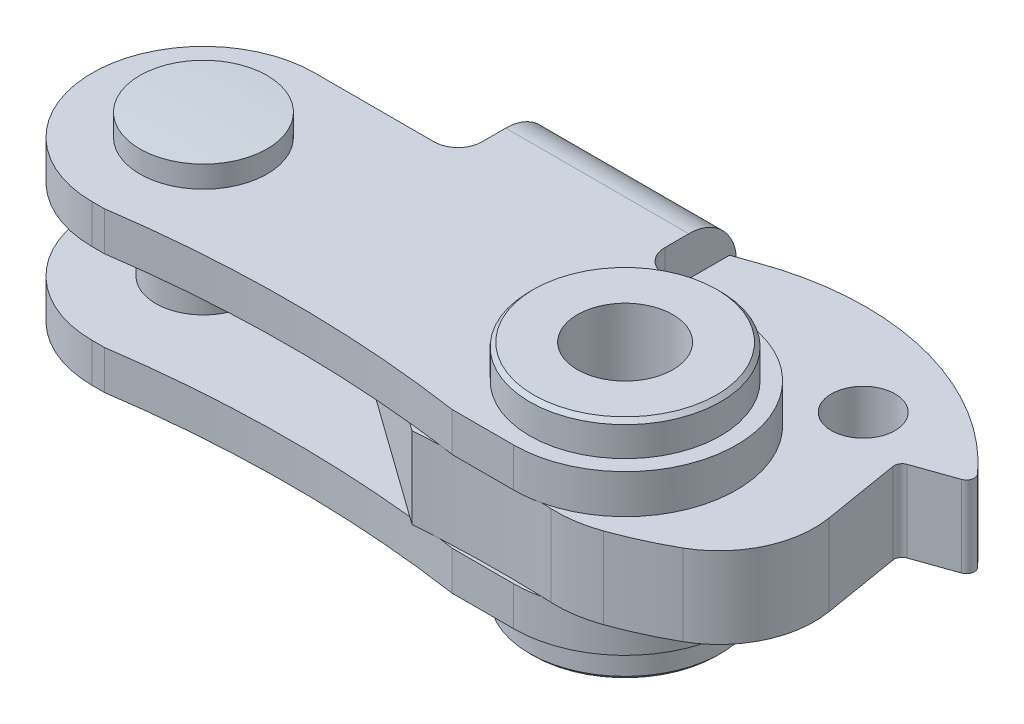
ISO-10303-21;
HEADER;
FILE_DESCRIPTION(('STEP AP214'),'2;1');
FILE_NAME('part.step','',(''),(''),'','','');
FILE_SCHEMA(('AUTOMOTIVE_DESIGN { 1 0 10303 214 1 1 1 1 }'));
ENDSEC;
DATA;
#1=APPLICATION_CONTEXT('core data for automotive mechanical design processes');
#2=APPLICATION_PROTOCOL_DEFINITION('international standard','automotive_design',2000,#1);
#3=PRODUCT_CONTEXT('',#1,'mechanical');
#4=PRODUCT('Part','Part','',(#3));
#5=PRODUCT_RELATED_PRODUCT_CATEGORY('part','',(#4));
#6=PRODUCT_DEFINITION_FORMATION('','',#4);
#7=PRODUCT_DEFINITION_CONTEXT('part definition',#1,'design');
#8=PRODUCT_DEFINITION('design','',#6,#7);
#9=PRODUCT_DEFINITION_SHAPE('','',#8);
#10=(LENGTH_UNIT() NAMED_UNIT(*) SI_UNIT(.MILLI.,.METRE.));
#11=(NAMED_UNIT(*) PLANE_ANGLE_UNIT() SI_UNIT($,.RADIAN.));
#12=(NAMED_UNIT(*) SI_UNIT($,.STERADIAN.) SOLID_ANGLE_UNIT());
#13=UNCERTAINTY_MEASURE_WITH_UNIT(LENGTH_MEASURE(1.E-05),#10,'distance_accuracy_value','');
#14=(GEOMETRIC_REPRESENTATION_CONTEXT(3) GLOBAL_UNCERTAINTY_ASSIGNED_CONTEXT((#13)) GLOBAL_UNIT_ASSIGNED_CONTEXT((#10,
#11,#12)) REPRESENTATION_CONTEXT('',''));
#15=CARTESIAN_POINT('',(0.,0.,0.));
#16=DIRECTION('',(0.,0.,1.));
#17=DIRECTION('',(1.,0.,0.));
#18=AXIS2_PLACEMENT_3D('',#15,#16,#17);
#19=CARTESIAN_POINT('',(11.7,10.,81.2));
#20=DIRECTION('',(0.,1.,0.));
#21=DIRECTION('',(0.,0.,1.));
#22=AXIS2_PLACEMENT_3D('',#19,#20,#21);
#23=CYLINDRICAL_SURFACE('',#22,75.);
#24=CARTESIAN_POINT('',(11.7,-2.55,81.2));
#25=DIRECTION('',(0.,-1.,0.));
#26=DIRECTION('',(0.,0.,1.));
#27=AXIS2_PLACEMENT_3D('',#24,#25,#26);
#28=CIRCLE('',#27,75.);
#29=CARTESIAN_POINT('',(21.6854159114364,-2.55,6.8676956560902));
#30=VERTEX_POINT('',#29);
#31=CARTESIAN_POINT('',(22.625200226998,-2.55,7.));
#32=VERTEX_POINT('',#31);
#33=EDGE_CURVE('E528',#30,#32,#28,.T.);
#34=ORIENTED_EDGE('',*,*,#33,.F.);
#35=CARTESIAN_POINT('',(11.7,-2.55,81.2));
#36=DIRECTION('',(0.,-1.,0.));
#37=DIRECTION('',(0.,0.,-1.));
#38=AXIS2_PLACEMENT_3D('',#35,#36,#37);
#39=CIRCLE('',#38,75.);
#40=CARTESIAN_POINT('',(19.583247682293,-2.55,6.61545464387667));
#41=VERTEX_POINT('',#40);
#42=EDGE_CURVE('E544',#41,#30,#39,.T.);
#43=ORIENTED_EDGE('',*,*,#42,.F.);
#44=CARTESIAN_POINT('',(11.7,-2.55,81.2));
#45=DIRECTION('',(0.,-1.,0.));
#46=DIRECTION('',(0.,0.,1.));
#47=AXIS2_PLACEMENT_3D('',#44,#45,#46);
#48=CIRCLE('',#47,75.);
#49=CARTESIAN_POINT('',(0.774799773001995,-2.55,7.));
#50=VERTEX_POINT('',#49);
#51=EDGE_CURVE('E584',#50,#41,#48,.T.);
#52=ORIENTED_EDGE('',*,*,#51,.F.);
#53=DIRECTION('',(0.,1.,0.));
#54=VECTOR('',#53,1.);
#55=CARTESIAN_POINT('',(0.774799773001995,10.,7.));
#56=LINE('',#55,#54);
#57=CARTESIAN_POINT('',(0.774799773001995,-5.,7.));
#58=VERTEX_POINT('',#57);
#59=EDGE_CURVE('E511',#58,#50,#56,.T.);
#60=ORIENTED_EDGE('',*,*,#59,.F.);
#61=CARTESIAN_POINT('',(11.7,-5.,81.2));
#62=DIRECTION('',(0.,1.,0.));
#63=DIRECTION('',(0.,0.,1.));
#64=AXIS2_PLACEMENT_3D('',#61,#62,#63);
#65=CIRCLE('',#64,75.);
#66=CARTESIAN_POINT('',(22.625200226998,-5.,7.));
#67=VERTEX_POINT('',#66);
#68=EDGE_CURVE('E355',#58,#67,#65,.F.);
#69=ORIENTED_EDGE('',*,*,#68,.T.);
#70=DIRECTION('',(0.,1.,0.));
#71=VECTOR('',#70,1.);
#72=CARTESIAN_POINT('',(22.625200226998,10.,7.));
#73=LINE('',#72,#71);
#74=EDGE_CURVE('E515',#32,#67,#73,.F.);
#75=ORIENTED_EDGE('',*,*,#74,.F.);
#76=EDGE_LOOP('',(#34,#43,#52,#60,#69,#75));
#77=FACE_BOUND('',#76,.T.);
#78=ADVANCED_FACE('F14',(#77),#23,.F.);
#79=CARTESIAN_POINT('',(0.,5.,7.));
#80=DIRECTION('',(0.,0.,1.));
#81=DIRECTION('',(0.,-1.,0.));
#82=AXIS2_PLACEMENT_3D('',#79,#80,#81);
#83=PLANE('',#82);
#84=DIRECTION('',(0.,-1.,0.));
#85=VECTOR('',#84,1.);
#86=CARTESIAN_POINT('',(26.5,5.,7.));
#87=LINE('',#86,#85);
#88=CARTESIAN_POINT('',(26.5,-5.,7.));
#89=VERTEX_POINT('',#88);
#90=CARTESIAN_POINT('',(26.5,-2.55,7.));
#91=VERTEX_POINT('',#90);
#92=EDGE_CURVE('E364',#89,#91,#87,.F.);
#93=ORIENTED_EDGE('',*,*,#92,.T.);
#94=DIRECTION('',(1.,0.,0.));
#95=VECTOR('',#94,1.);
#96=CARTESIAN_POINT('',(22.625200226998,-2.55,7.));
#97=LINE('',#96,#95);
#98=EDGE_CURVE('E521',#32,#91,#97,.T.);
#99=ORIENTED_EDGE('',*,*,#98,.F.);
#100=ORIENTED_EDGE('',*,*,#74,.T.);
#101=DIRECTION('',(1.,0.,0.));
#102=VECTOR('',#101,1.);
#103=CARTESIAN_POINT('',(0.,-5.,7.));
#104=LINE('',#103,#102);
#105=EDGE_CURVE('E441',#67,#89,#104,.T.);
#106=ORIENTED_EDGE('',*,*,#105,.T.);
#107=EDGE_LOOP('',(#93,#99,#100,#106));
#108=FACE_BOUND('',#107,.T.);
#109=ADVANCED_FACE('F520',(#108),#83,.T.);
#110=CARTESIAN_POINT('',(11.7,10.,81.2));
#111=DIRECTION('',(0.,1.,0.));
#112=DIRECTION('',(0.,0.,1.));
#113=AXIS2_PLACEMENT_3D('',#110,#111,#112);
#114=CYLINDRICAL_SURFACE('',#113,75.);
#115=CARTESIAN_POINT('',(11.7,2.55,81.2));
#116=DIRECTION('',(0.,1.,0.));
#117=DIRECTION('',(0.,0.,-1.));
#118=AXIS2_PLACEMENT_3D('',#115,#116,#117);
#119=CIRCLE('',#118,75.);
#120=CARTESIAN_POINT('',(22.625200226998,2.55,7.));
#121=VERTEX_POINT('',#120);
#122=CARTESIAN_POINT('',(21.6854159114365,2.55,6.8676956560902));
#123=VERTEX_POINT('',#122);
#124=EDGE_CURVE('E541',#121,#123,#119,.T.);
#125=ORIENTED_EDGE('',*,*,#124,.F.);
#126=DIRECTION('',(0.,-1.,0.));
#127=VECTOR('',#126,1.);
#128=CARTESIAN_POINT('',(22.625200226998,5.,7.));
#129=LINE('',#128,#127);
#130=CARTESIAN_POINT('',(22.625200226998,5.,7.));
#131=VERTEX_POINT('',#130);
#132=EDGE_CURVE('E467',#131,#121,#129,.T.);
#133=ORIENTED_EDGE('',*,*,#132,.F.);
#134=CARTESIAN_POINT('',(11.7,5.,81.2));
#135=DIRECTION('',(0.,1.,0.));
#136=DIRECTION('',(0.,0.,1.));
#137=AXIS2_PLACEMENT_3D('',#134,#135,#136);
#138=CIRCLE('',#137,75.);
#139=CARTESIAN_POINT('',(0.774799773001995,5.,7.));
#140=VERTEX_POINT('',#139);
#141=EDGE_CURVE('E398',#140,#131,#138,.F.);
#142=ORIENTED_EDGE('',*,*,#141,.F.);
#143=DIRECTION('',(0.,1.,0.));
#144=VECTOR('',#143,1.);
#145=CARTESIAN_POINT('',(0.774799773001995,10.,7.));
#146=LINE('',#145,#144);
#147=CARTESIAN_POINT('',(0.774799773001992,2.55,7.));
#148=VERTEX_POINT('',#147);
#149=EDGE_CURVE('E470',#148,#140,#146,.T.);
#150=ORIENTED_EDGE('',*,*,#149,.F.);
#151=CARTESIAN_POINT('',(11.7,2.55,81.2));
#152=DIRECTION('',(0.,1.,0.));
#153=DIRECTION('',(0.,0.,-1.));
#154=AXIS2_PLACEMENT_3D('',#151,#152,#153);
#155=CIRCLE('',#154,75.);
#156=CARTESIAN_POINT('',(19.583247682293,2.55,6.61545464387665));
#157=VERTEX_POINT('',#156);
#158=EDGE_CURVE('E624',#157,#148,#155,.T.);
#159=ORIENTED_EDGE('',*,*,#158,.F.);
#160=CARTESIAN_POINT('',(11.7,2.55,81.2));
#161=DIRECTION('',(0.,1.,0.));
#162=DIRECTION('',(0.,0.,1.));
#163=AXIS2_PLACEMENT_3D('',#160,#161,#162);
#164=CIRCLE('',#163,75.);
#165=EDGE_CURVE('E553',#123,#157,#164,.T.);
#166=ORIENTED_EDGE('',*,*,#165,.F.);
#167=EDGE_LOOP('',(#125,#133,#142,#150,#159,#166));
#168=FACE_BOUND('',#167,.T.);
#169=ADVANCED_FACE('F747',(#168),#114,.F.);
#170=CARTESIAN_POINT('',(0.,5.,7.));
#171=DIRECTION('',(0.,0.,1.));
#172=DIRECTION('',(0.,-1.,0.));
#173=AXIS2_PLACEMENT_3D('',#170,#171,#172);
#174=PLANE('',#173);
#175=ORIENTED_EDGE('',*,*,#132,.T.);
#176=DIRECTION('',(-1.,0.,0.));
#177=VECTOR('',#176,1.);
#178=CARTESIAN_POINT('',(26.5,2.55,7.));
#179=LINE('',#178,#177);
#180=CARTESIAN_POINT('',(26.5,2.55,7.));
#181=VERTEX_POINT('',#180);
#182=EDGE_CURVE('E539',#181,#121,#179,.T.);
#183=ORIENTED_EDGE('',*,*,#182,.F.);
#184=DIRECTION('',(0.,1.,0.));
#185=VECTOR('',#184,1.);
#186=CARTESIAN_POINT('',(26.5,5.,7.));
#187=LINE('',#186,#185);
#188=CARTESIAN_POINT('',(26.5,5.,7.));
#189=VERTEX_POINT('',#188);
#190=EDGE_CURVE('E464',#189,#181,#187,.F.);
#191=ORIENTED_EDGE('',*,*,#190,.F.);
#192=DIRECTION('',(1.,0.,0.));
#193=VECTOR('',#192,1.);
#194=CARTESIAN_POINT('',(0.,5.,7.));
#195=LINE('',#194,#193);
#196=EDGE_CURVE('E397',#131,#189,#195,.T.);
#197=ORIENTED_EDGE('',*,*,#196,.F.);
#198=EDGE_LOOP('',(#175,#183,#191,#197));
#199=FACE_BOUND('',#198,.T.);
#200=ADVANCED_FACE('F743',(#199),#174,.T.);
#201=CARTESIAN_POINT('',(0.,5.,7.));
#202=DIRECTION('',(0.,0.,1.));
#203=DIRECTION('',(0.,-1.,0.));
#204=AXIS2_PLACEMENT_3D('',#201,#202,#203);
#205=PLANE('',#204);
#206=ORIENTED_EDGE('',*,*,#59,.T.);
#207=DIRECTION('',(1.,0.,0.));
#208=VECTOR('',#207,1.);
#209=CARTESIAN_POINT('',(0.,-2.55,7.));
#210=LINE('',#209,#208);
#211=CARTESIAN_POINT('',(0.,-2.55,7.));
#212=VERTEX_POINT('',#211);
#213=EDGE_CURVE('E582',#212,#50,#210,.T.);
#214=ORIENTED_EDGE('',*,*,#213,.F.);
#215=DIRECTION('',(0.,1.,0.));
#216=VECTOR('',#215,1.);
#217=CARTESIAN_POINT('',(0.,5.,7.));
#218=LINE('',#217,#216);
#219=CARTESIAN_POINT('',(0.,-5.,7.));
#220=VERTEX_POINT('',#219);
#221=EDGE_CURVE('E374',#220,#212,#218,.T.);
#222=ORIENTED_EDGE('',*,*,#221,.F.);
#223=DIRECTION('',(1.,0.,0.));
#224=VECTOR('',#223,1.);
#225=CARTESIAN_POINT('',(0.,-5.,7.));
#226=LINE('',#225,#224);
#227=EDGE_CURVE('E377',#220,#58,#226,.T.);
#228=ORIENTED_EDGE('',*,*,#227,.T.);
#229=EDGE_LOOP('',(#206,#214,#222,#228));
#230=FACE_BOUND('',#229,.T.);
#231=ADVANCED_FACE('F746',(#230),#205,.T.);
#232=CARTESIAN_POINT('',(0.,5.,0.));
#233=DIRECTION('',(0.,1.,0.));
#234=DIRECTION('',(0.,0.,1.));
#235=AXIS2_PLACEMENT_3D('',#232,#233,#234);
#236=CYLINDRICAL_SURFACE('',#235,7.);
#237=ORIENTED_EDGE('',*,*,#221,.T.);
#238=CARTESIAN_POINT('',(0.,-2.55,0.));
#239=DIRECTION('',(0.,1.,0.));
#240=DIRECTION('',(0.,0.,1.));
#241=AXIS2_PLACEMENT_3D('',#238,#239,#240);
#242=CIRCLE('',#241,7.);
#243=CARTESIAN_POINT('',(0.,-2.55,-7.));
#244=VERTEX_POINT('',#243);
#245=EDGE_CURVE('E580',#244,#212,#242,.T.);
#246=ORIENTED_EDGE('',*,*,#245,.F.);
#247=DIRECTION('',(0.,1.,0.));
#248=VECTOR('',#247,1.);
#249=CARTESIAN_POINT('',(0.,5.,-7.));
#250=LINE('',#249,#248);
#251=CARTESIAN_POINT('',(0.,-5.,-7.));
#252=VERTEX_POINT('',#251);
#253=EDGE_CURVE('E370',#252,#244,#250,.T.);
#254=ORIENTED_EDGE('',*,*,#253,.F.);
#255=CARTESIAN_POINT('',(0.,-5.,0.));
#256=DIRECTION('',(0.,1.,0.));
#257=DIRECTION('',(0.,0.,1.));
#258=AXIS2_PLACEMENT_3D('',#255,#256,#257);
#259=CIRCLE('',#258,7.);
#260=EDGE_CURVE('E360',#252,#220,#259,.T.);
#261=ORIENTED_EDGE('',*,*,#260,.T.);
#262=EDGE_LOOP('',(#237,#246,#254,#261));
#263=FACE_BOUND('',#262,.T.);
#264=ADVANCED_FACE('F803',(#263),#236,.T.);
#265=CARTESIAN_POINT('',(7.5,5.,-7.));
#266=DIRECTION('',(0.,0.,-1.));
#267=DIRECTION('',(0.,1.,0.));
#268=AXIS2_PLACEMENT_3D('',#265,#266,#267);
#269=PLANE('',#268);
#270=ORIENTED_EDGE('',*,*,#253,.T.);
#271=DIRECTION('',(-1.,0.,0.));
#272=VECTOR('',#271,1.);
#273=CARTESIAN_POINT('',(7.5,-2.55,-7.));
#274=LINE('',#273,#272);
#275=CARTESIAN_POINT('',(7.5,-2.55,-7.));
#276=VERTEX_POINT('',#275);
#277=EDGE_CURVE('E578',#276,#244,#274,.T.);
#278=ORIENTED_EDGE('',*,*,#277,.F.);
#279=DIRECTION('',(0.,1.,0.));
#280=VECTOR('',#279,1.);
#281=CARTESIAN_POINT('',(7.5,5.,-7.));
#282=LINE('',#281,#280);
#283=CARTESIAN_POINT('',(7.5,-5.,-7.));
#284=VERTEX_POINT('',#283);
#285=EDGE_CURVE('E366',#276,#284,#282,.F.);
#286=ORIENTED_EDGE('',*,*,#285,.T.);
#287=DIRECTION('',(1.,0.,0.));
#288=VECTOR('',#287,1.);
#289=CARTESIAN_POINT('',(0.,-5.,-7.));
#290=LINE('',#289,#288);
#291=EDGE_CURVE('E435',#284,#252,#290,.F.);
#292=ORIENTED_EDGE('',*,*,#291,.T.);
#293=EDGE_LOOP('',(#270,#278,#286,#292));
#294=FACE_BOUND('',#293,.T.);
#295=ADVANCED_FACE('F781',(#294),#269,.T.);
#296=CARTESIAN_POINT('',(7.5,5.,-8.5));
#297=DIRECTION('',(0.,1.,0.));
#298=DIRECTION('',(0.,0.,1.));
#299=AXIS2_PLACEMENT_3D('',#296,#297,#298);
#300=CYLINDRICAL_SURFACE('',#299,1.5);
#301=CARTESIAN_POINT('',(7.5,-2.55,-8.5));
#302=DIRECTION('',(0.,-1.,0.));
#303=DIRECTION('',(0.,0.,1.));
#304=AXIS2_PLACEMENT_3D('',#301,#302,#303);
#305=CIRCLE('',#304,1.5);
#306=CARTESIAN_POINT('',(9.,-2.55,-8.5));
#307=VERTEX_POINT('',#306);
#308=EDGE_CURVE('E576',#307,#276,#305,.T.);
#309=ORIENTED_EDGE('',*,*,#308,.F.);
#310=DIRECTION('',(0.,1.,0.));
#311=VECTOR('',#310,1.);
#312=CARTESIAN_POINT('',(9.,5.,-8.5));
#313=LINE('',#312,#311);
#314=CARTESIAN_POINT('',(9.,-5.,-8.5));
#315=VERTEX_POINT('',#314);
#316=EDGE_CURVE('E476',#315,#307,#313,.T.);
#317=ORIENTED_EDGE('',*,*,#316,.F.);
#318=CARTESIAN_POINT('',(7.5,-5.,-8.5));
#319=DIRECTION('',(0.,1.,0.));
#320=DIRECTION('',(0.,0.,1.));
#321=AXIS2_PLACEMENT_3D('',#318,#319,#320);
#322=CIRCLE('',#321,1.5);
#323=EDGE_CURVE('E436',#315,#284,#322,.F.);
#324=ORIENTED_EDGE('',*,*,#323,.T.);
#325=ORIENTED_EDGE('',*,*,#285,.F.);
#326=EDGE_LOOP('',(#309,#317,#324,#325));
#327=FACE_BOUND('',#326,.T.);
#328=ADVANCED_FACE('F726',(#327),#300,.F.);
#329=CARTESIAN_POINT('',(7.5,5.,-8.5));
#330=DIRECTION('',(0.,1.,0.));
#331=DIRECTION('',(0.,0.,1.));
#332=AXIS2_PLACEMENT_3D('',#329,#330,#331);
#333=CYLINDRICAL_SURFACE('',#332,1.5);
#334=CARTESIAN_POINT('',(7.5,2.55,-8.5));
#335=DIRECTION('',(0.,1.,0.));
#336=DIRECTION('',(0.,0.,-1.));
#337=AXIS2_PLACEMENT_3D('',#334,#335,#336);
#338=CIRCLE('',#337,1.5);
#339=CARTESIAN_POINT('',(7.5,2.55,-7.));
#340=VERTEX_POINT('',#339);
#341=CARTESIAN_POINT('',(9.,2.55,-8.5));
#342=VERTEX_POINT('',#341);
#343=EDGE_CURVE('E632',#340,#342,#338,.T.);
#344=ORIENTED_EDGE('',*,*,#343,.F.);
#345=DIRECTION('',(0.,1.,0.));
#346=VECTOR('',#345,1.);
#347=CARTESIAN_POINT('',(7.5,5.,-7.));
#348=LINE('',#347,#346);
#349=CARTESIAN_POINT('',(7.5,5.,-7.));
#350=VERTEX_POINT('',#349);
#351=EDGE_CURVE('E934',#350,#340,#348,.F.);
#352=ORIENTED_EDGE('',*,*,#351,.F.);
#353=CARTESIAN_POINT('',(7.5,5.,-8.5));
#354=DIRECTION('',(0.,1.,0.));
#355=DIRECTION('',(0.,0.,1.));
#356=AXIS2_PLACEMENT_3D('',#353,#354,#355);
#357=CIRCLE('',#356,1.5);
#358=CARTESIAN_POINT('',(9.,5.,-8.5));
#359=VERTEX_POINT('',#358);
#360=EDGE_CURVE('E386',#359,#350,#357,.F.);
#361=ORIENTED_EDGE('',*,*,#360,.F.);
#362=DIRECTION('',(0.,1.,0.));
#363=VECTOR('',#362,1.);
#364=CARTESIAN_POINT('',(9.,5.,-8.5));
#365=LINE('',#364,#363);
#366=EDGE_CURVE('E405',#342,#359,#365,.T.);
#367=ORIENTED_EDGE('',*,*,#366,.F.);
#368=EDGE_LOOP('',(#344,#352,#361,#367));
#369=FACE_BOUND('',#368,.T.);
#370=ADVANCED_FACE('F722',(#369),#333,.F.);
#371=CARTESIAN_POINT('',(7.5,5.,-7.));
#372=DIRECTION('',(0.,0.,-1.));
#373=DIRECTION('',(0.,1.,0.));
#374=AXIS2_PLACEMENT_3D('',#371,#372,#373);
#375=PLANE('',#374);
#376=ORIENTED_EDGE('',*,*,#351,.T.);
#377=DIRECTION('',(1.,0.,0.));
#378=VECTOR('',#377,1.);
#379=CARTESIAN_POINT('',(0.,2.55,-7.));
#380=LINE('',#379,#378);
#381=CARTESIAN_POINT('',(0.,2.55,-7.));
#382=VERTEX_POINT('',#381);
#383=EDGE_CURVE('E630',#382,#340,#380,.T.);
#384=ORIENTED_EDGE('',*,*,#383,.F.);
#385=DIRECTION('',(0.,1.,0.));
#386=VECTOR('',#385,1.);
#387=CARTESIAN_POINT('',(0.,5.,-7.));
#388=LINE('',#387,#386);
#389=CARTESIAN_POINT('',(0.,5.,-7.));
#390=VERTEX_POINT('',#389);
#391=EDGE_CURVE('E401',#390,#382,#388,.F.);
#392=ORIENTED_EDGE('',*,*,#391,.F.);
#393=DIRECTION('',(1.,0.,0.));
#394=VECTOR('',#393,1.);
#395=CARTESIAN_POINT('',(0.,5.,-7.));
#396=LINE('',#395,#394);
#397=EDGE_CURVE('E385',#350,#390,#396,.F.);
#398=ORIENTED_EDGE('',*,*,#397,.F.);
#399=EDGE_LOOP('',(#376,#384,#392,#398));
#400=FACE_BOUND('',#399,.T.);
#401=ADVANCED_FACE('F718',(#400),#375,.T.);
#402=CARTESIAN_POINT('',(0.,5.,0.));
#403=DIRECTION('',(0.,1.,0.));
#404=DIRECTION('',(0.,0.,1.));
#405=AXIS2_PLACEMENT_3D('',#402,#403,#404);
#406=CYLINDRICAL_SURFACE('',#405,7.);
#407=ORIENTED_EDGE('',*,*,#391,.T.);
#408=CARTESIAN_POINT('',(0.,2.55,0.));
#409=DIRECTION('',(0.,-1.,0.));
#410=DIRECTION('',(0.,0.,-1.));
#411=AXIS2_PLACEMENT_3D('',#408,#409,#410);
#412=CIRCLE('',#411,7.);
#413=CARTESIAN_POINT('',(0.,2.55,7.));
#414=VERTEX_POINT('',#413);
#415=EDGE_CURVE('E628',#414,#382,#412,.T.);
#416=ORIENTED_EDGE('',*,*,#415,.F.);
#417=DIRECTION('',(0.,1.,0.));
#418=VECTOR('',#417,1.);
#419=CARTESIAN_POINT('',(0.,5.,7.));
#420=LINE('',#419,#418);
#421=CARTESIAN_POINT('',(0.,5.,7.));
#422=VERTEX_POINT('',#421);
#423=EDGE_CURVE('E932',#414,#422,#420,.T.);
#424=ORIENTED_EDGE('',*,*,#423,.T.);
#425=CARTESIAN_POINT('',(0.,5.,0.));
#426=DIRECTION('',(0.,1.,0.));
#427=DIRECTION('',(0.,0.,1.));
#428=AXIS2_PLACEMENT_3D('',#425,#426,#427);
#429=CIRCLE('',#428,7.);
#430=EDGE_CURVE('E381',#390,#422,#429,.T.);
#431=ORIENTED_EDGE('',*,*,#430,.F.);
#432=EDGE_LOOP('',(#407,#416,#424,#431));
#433=FACE_BOUND('',#432,.T.);
#434=ADVANCED_FACE('F715',(#433),#406,.T.);
#435=CARTESIAN_POINT('',(0.,5.,7.));
#436=DIRECTION('',(0.,0.,1.));
#437=DIRECTION('',(0.,-1.,0.));
#438=AXIS2_PLACEMENT_3D('',#435,#436,#437);
#439=PLANE('',#438);
#440=ORIENTED_EDGE('',*,*,#423,.F.);
#441=DIRECTION('',(-1.,0.,0.));
#442=VECTOR('',#441,1.);
#443=CARTESIAN_POINT('',(0.774799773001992,2.55,7.));
#444=LINE('',#443,#442);
#445=EDGE_CURVE('E626',#148,#414,#444,.T.);
#446=ORIENTED_EDGE('',*,*,#445,.F.);
#447=ORIENTED_EDGE('',*,*,#149,.T.);
#448=DIRECTION('',(1.,0.,0.));
#449=VECTOR('',#448,1.);
#450=CARTESIAN_POINT('',(0.,5.,7.));
#451=LINE('',#450,#449);
#452=EDGE_CURVE('E473',#140,#422,#451,.F.);
#453=ORIENTED_EDGE('',*,*,#452,.T.);
#454=EDGE_LOOP('',(#440,#446,#447,#453));
#455=FACE_BOUND('',#454,.T.);
#456=ADVANCED_FACE('F707',(#455),#439,.T.);
#457=CARTESIAN_POINT('',(0.,-4.70000000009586,0.));
#458=DIRECTION('',(0.,-1.,0.));
#459=DIRECTION('',(0.,0.,-1.));
#460=AXIS2_PLACEMENT_3D('',#457,#458,#459);
#461=CONICAL_SURFACE('',#460,2.00000000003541,1.0471975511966);
#462=CARTESIAN_POINT('',(0.,-4.7,0.));
#463=DIRECTION('',(0.,-1.,0.));
#464=DIRECTION('',(0.,0.,-1.));
#465=AXIS2_PLACEMENT_3D('',#462,#463,#464);
#466=CIRCLE('',#465,2.);
#467=CARTESIAN_POINT('',(0.,-4.7,-2.));
#468=VERTEX_POINT('',#467);
#469=EDGE_CURVE('E384',#468,#468,#466,.T.);
#470=ORIENTED_EDGE('',*,*,#469,.T.);
#471=EDGE_LOOP('',(#470));
#472=FACE_BOUND('',#471,.T.);
#473=CARTESIAN_POINT('',(8.43491942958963E-11,-3.54529946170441,0.));
#474=VERTEX_POINT('',#473);
#475=VERTEX_LOOP('',#474);
#476=FACE_BOUND('',#475,.T.);
#477=ADVANCED_FACE('F703',(#472,#476),#461,.F.);
#478=CARTESIAN_POINT('',(0.,-5.68332870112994,0.));
#479=DIRECTION('',(0.,-1.,0.));
#480=DIRECTION('',(0.,0.,-1.));
#481=AXIS2_PLACEMENT_3D('',#478,#479,#480);
#482=CYLINDRICAL_SURFACE('',#481,2.);
#483=ORIENTED_EDGE('',*,*,#469,.F.);
#484=EDGE_LOOP('',(#483));
#485=FACE_BOUND('',#484,.T.);
#486=CARTESIAN_POINT('',(0.,-6.6666574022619,0.));
#487=DIRECTION('',(0.,-1.,0.));
#488=DIRECTION('',(-1.,0.,0.));
#489=AXIS2_PLACEMENT_3D('',#486,#487,#488);
#490=CIRCLE('',#489,2.00000000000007);
#491=CARTESIAN_POINT('',(-2.00000000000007,-6.6666574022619,0.));
#492=VERTEX_POINT('',#491);
#493=EDGE_CURVE('E1153',#492,#492,#490,.F.);
#494=ORIENTED_EDGE('',*,*,#493,.F.);
#495=EDGE_LOOP('',(#494));
#496=FACE_BOUND('',#495,.T.);
#497=ADVANCED_FACE('F699',(#485,#496),#482,.F.);
#498=CARTESIAN_POINT('',(0.,53.3000000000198,0.));
#499=DIRECTION('',(0.,-1.,0.));
#500=DIRECTION('',(-1.,0.,0.));
#501=AXIS2_PLACEMENT_3D('',#498,#499,#500);
#502=SPHERICAL_SURFACE('',#501,60.0000000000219);
#503=CARTESIAN_POINT('',(0.,-6.56651818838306,0.));
#504=DIRECTION('',(0.,-1.,0.));
#505=DIRECTION('',(0.,0.,-1.));
#506=AXIS2_PLACEMENT_3D('',#503,#504,#505);
#507=CIRCLE('',#506,4.);
#508=CARTESIAN_POINT('',(0.,-6.56651818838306,-4.));
#509=VERTEX_POINT('',#508);
#510=EDGE_CURVE('E682',#509,#509,#507,.F.);
#511=ORIENTED_EDGE('',*,*,#510,.F.);
#512=EDGE_LOOP('',(#511));
#513=FACE_BOUND('',#512,.T.);
#514=ORIENTED_EDGE('',*,*,#493,.T.);
#515=EDGE_LOOP('',(#514));
#516=FACE_BOUND('',#515,.T.);
#517=ADVANCED_FACE('F696',(#513,#516),#502,.T.);
#518=CARTESIAN_POINT('',(0.,-5.88325909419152,0.));
#519=DIRECTION('',(0.,-1.,0.));
#520=DIRECTION('',(0.,0.,-1.));
#521=AXIS2_PLACEMENT_3D('',#518,#519,#520);
#522=CYLINDRICAL_SURFACE('',#521,4.);
#523=CARTESIAN_POINT('',(0.,-5.2,0.));
#524=DIRECTION('',(0.,-1.,0.));
#525=DIRECTION('',(0.,0.,-1.));
#526=AXIS2_PLACEMENT_3D('',#523,#524,#525);
#527=CIRCLE('',#526,4.);
#528=CARTESIAN_POINT('',(0.,-5.2,-4.));
#529=VERTEX_POINT('',#528);
#530=EDGE_CURVE('E681',#529,#529,#527,.F.);
#531=ORIENTED_EDGE('',*,*,#530,.F.);
#532=EDGE_LOOP('',(#531));
#533=FACE_BOUND('',#532,.T.);
#534=ORIENTED_EDGE('',*,*,#510,.T.);
#535=EDGE_LOOP('',(#534));
#536=FACE_BOUND('',#535,.T.);
#537=ADVANCED_FACE('F693',(#533,#536),#522,.T.);
#538=CARTESIAN_POINT('',(0.,-53.4999999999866,0.));
#539=DIRECTION('',(0.,-1.,0.));
#540=DIRECTION('',(-1.,0.,0.));
#541=AXIS2_PLACEMENT_3D('',#538,#539,#540);
#542=SPHERICAL_SURFACE('',#541,59.9999999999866);
#543=CARTESIAN_POINT('',(0.,6.36651818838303,0.));
#544=DIRECTION('',(0.,-1.,0.));
#545=DIRECTION('',(0.,0.,-1.));
#546=AXIS2_PLACEMENT_3D('',#543,#544,#545);
#547=CIRCLE('',#546,4.);
#548=CARTESIAN_POINT('',(0.,6.36651818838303,-4.));
#549=VERTEX_POINT('',#548);
#550=EDGE_CURVE('E678',#549,#549,#547,.T.);
#551=ORIENTED_EDGE('',*,*,#550,.F.);
#552=EDGE_LOOP('',(#551));
#553=FACE_BOUND('',#552,.T.);
#554=CARTESIAN_POINT('',(0.,6.5,0.));
#555=VERTEX_POINT('',#554);
#556=VERTEX_LOOP('',#555);
#557=FACE_BOUND('',#556,.T.);
#558=ADVANCED_FACE('F688',(#553,#557),#542,.T.);
#559=CARTESIAN_POINT('',(-3.5,-5.2,0.));
#560=DIRECTION('',(0.,1.,0.));
#561=DIRECTION('',(0.,0.,1.));
#562=AXIS2_PLACEMENT_3D('',#559,#560,#561);
#563=PLANE('',#562);
#564=ORIENTED_EDGE('',*,*,#530,.T.);
#565=EDGE_LOOP('',(#564));
#566=FACE_BOUND('',#565,.T.);
#567=CARTESIAN_POINT('',(0.,-5.2,0.));
#568=DIRECTION('',(0.,-1.,0.));
#569=DIRECTION('',(0.,0.,-1.));
#570=AXIS2_PLACEMENT_3D('',#567,#568,#569);
#571=CIRCLE('',#570,3.);
#572=CARTESIAN_POINT('',(0.,-5.2,-3.));
#573=VERTEX_POINT('',#572);
#574=EDGE_CURVE('E431',#573,#573,#571,.F.);
#575=ORIENTED_EDGE('',*,*,#574,.F.);
#576=EDGE_LOOP('',(#575));
#577=FACE_BOUND('',#576,.T.);
#578=ADVANCED_FACE('F692',(#566,#577),#563,.T.);
#579=CARTESIAN_POINT('',(0.,5.68325909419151,0.));
#580=DIRECTION('',(0.,-1.,0.));
#581=DIRECTION('',(0.,0.,-1.));
#582=AXIS2_PLACEMENT_3D('',#579,#580,#581);
#583=CYLINDRICAL_SURFACE('',#582,4.);
#584=ORIENTED_EDGE('',*,*,#550,.T.);
#585=EDGE_LOOP('',(#584));
#586=FACE_BOUND('',#585,.T.);
#587=CARTESIAN_POINT('',(0.,5.,0.));
#588=DIRECTION('',(0.,-1.,0.));
#589=DIRECTION('',(0.,0.,-1.));
#590=AXIS2_PLACEMENT_3D('',#587,#588,#589);
#591=CIRCLE('',#590,4.);
#592=CARTESIAN_POINT('',(0.,5.,-4.));
#593=VERTEX_POINT('',#592);
#594=EDGE_CURVE('E1144',#593,#593,#591,.T.);
#595=ORIENTED_EDGE('',*,*,#594,.F.);
#596=EDGE_LOOP('',(#595));
#597=FACE_BOUND('',#596,.T.);
#598=ADVANCED_FACE('F1132',(#586,#597),#583,.T.);
#599=CARTESIAN_POINT('',(0.,-0.1,0.));
#600=DIRECTION('',(0.,-1.,0.));
#601=DIRECTION('',(0.,0.,-1.));
#602=AXIS2_PLACEMENT_3D('',#599,#600,#601);
#603=CYLINDRICAL_SURFACE('',#602,3.);
#604=ORIENTED_EDGE('',*,*,#574,.T.);
#605=EDGE_LOOP('',(#604));
#606=FACE_BOUND('',#605,.T.);
#607=CARTESIAN_POINT('',(0.,-5.,0.));
#608=DIRECTION('',(0.,1.,0.));
#609=DIRECTION('',(0.,0.,1.));
#610=AXIS2_PLACEMENT_3D('',#607,#608,#609);
#611=CIRCLE('',#610,3.);
#612=CARTESIAN_POINT('',(0.,-5.,3.00000000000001));
#613=VERTEX_POINT('',#612);
#614=EDGE_CURVE('E428',#613,#613,#611,.F.);
#615=ORIENTED_EDGE('',*,*,#614,.T.);
#616=EDGE_LOOP('',(#615));
#617=FACE_BOUND('',#616,.T.);
#618=ADVANCED_FACE('F771',(#606,#617),#603,.T.);
#619=CARTESIAN_POINT('',(26.5,5.,-7.));
#620=DIRECTION('',(0.,0.,-1.));
#621=DIRECTION('',(0.,1.,0.));
#622=AXIS2_PLACEMENT_3D('',#619,#620,#621);
#623=PLANE('',#622);
#624=DIRECTION('',(-1.,0.,0.));
#625=VECTOR('',#624,1.);
#626=CARTESIAN_POINT('',(26.5,-2.55,-7.));
#627=LINE('',#626,#625);
#628=CARTESIAN_POINT('',(26.5,-2.55,-7.));
#629=VERTEX_POINT('',#628);
#630=CARTESIAN_POINT('',(22.,-2.55,-7.));
#631=VERTEX_POINT('',#630);
#632=EDGE_CURVE('E329',#629,#631,#627,.T.);
#633=ORIENTED_EDGE('',*,*,#632,.F.);
#634=DIRECTION('',(0.,1.,0.));
#635=VECTOR('',#634,1.);
#636=CARTESIAN_POINT('',(26.5,5.,-7.));
#637=LINE('',#636,#635);
#638=CARTESIAN_POINT('',(26.5,-5.,-7.));
#639=VERTEX_POINT('',#638);
#640=EDGE_CURVE('E344',#629,#639,#637,.F.);
#641=ORIENTED_EDGE('',*,*,#640,.T.);
#642=DIRECTION('',(1.,0.,0.));
#643=VECTOR('',#642,1.);
#644=CARTESIAN_POINT('',(26.5,-5.,-7.));
#645=LINE('',#644,#643);
#646=CARTESIAN_POINT('',(22.,-5.,-7.));
#647=VERTEX_POINT('',#646);
#648=EDGE_CURVE('E354',#639,#647,#645,.F.);
#649=ORIENTED_EDGE('',*,*,#648,.T.);
#650=DIRECTION('',(0.,1.,0.));
#651=VECTOR('',#650,1.);
#652=CARTESIAN_POINT('',(22.,5.,-7.));
#653=LINE('',#652,#651);
#654=EDGE_CURVE('E347',#647,#631,#653,.T.);
#655=ORIENTED_EDGE('',*,*,#654,.T.);
#656=EDGE_LOOP('',(#633,#641,#649,#655));
#657=FACE_BOUND('',#656,.T.);
#658=ADVANCED_FACE('F342',(#657),#623,.T.);
#659=CARTESIAN_POINT('',(26.5,5.,0.));
#660=DIRECTION('',(0.,1.,0.));
#661=DIRECTION('',(0.,0.,1.));
#662=AXIS2_PLACEMENT_3D('',#659,#660,#661);
#663=CYLINDRICAL_SURFACE('',#662,7.);
#664=CARTESIAN_POINT('',(26.5,-2.55,0.));
#665=DIRECTION('',(0.,1.,0.));
#666=DIRECTION('',(0.,0.,-1.));
#667=AXIS2_PLACEMENT_3D('',#664,#665,#666);
#668=CIRCLE('',#667,7.);
#669=CARTESIAN_POINT('',(28.0908349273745,-2.55,6.81683535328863));
#670=VERTEX_POINT('',#669);
#671=EDGE_CURVE('E325',#670,#629,#668,.T.);
#672=ORIENTED_EDGE('',*,*,#671,.F.);
#673=CARTESIAN_POINT('',(26.5,-2.55,0.));
#674=DIRECTION('',(0.,1.,0.));
#675=DIRECTION('',(0.,0.,1.));
#676=AXIS2_PLACEMENT_3D('',#673,#674,#675);
#677=CIRCLE('',#676,7.);
#678=EDGE_CURVE('E524',#91,#670,#677,.T.);
#679=ORIENTED_EDGE('',*,*,#678,.F.);
#680=ORIENTED_EDGE('',*,*,#92,.F.);
#681=CARTESIAN_POINT('',(26.5,-5.,0.));
#682=DIRECTION('',(0.,1.,0.));
#683=DIRECTION('',(0.,0.,1.));
#684=AXIS2_PLACEMENT_3D('',#681,#682,#683);
#685=CIRCLE('',#684,7.);
#686=EDGE_CURVE('E352',#89,#639,#685,.T.);
#687=ORIENTED_EDGE('',*,*,#686,.T.);
#688=ORIENTED_EDGE('',*,*,#640,.F.);
#689=EDGE_LOOP('',(#672,#679,#680,#687,#688));
#690=FACE_BOUND('',#689,.T.);
#691=ADVANCED_FACE('F350',(#690),#663,.T.);
#692=CARTESIAN_POINT('',(9.,5.,-13.));
#693=DIRECTION('',(-1.,0.,0.));
#694=DIRECTION('',(0.,0.,1.));
#695=AXIS2_PLACEMENT_3D('',#692,#693,#694);
#696=PLANE('',#695);
#697=DIRECTION('',(0.,1.,0.));
#698=VECTOR('',#697,1.);
#699=CARTESIAN_POINT('',(9.,-2.55,-10.));
#700=LINE('',#699,#698);
#701=CARTESIAN_POINT('',(9.,-2.55,-10.));
#702=VERTEX_POINT('',#701);
#703=CARTESIAN_POINT('',(9.,-2.5,-10.));
#704=VERTEX_POINT('',#703);
#705=EDGE_CURVE('E597',#702,#704,#700,.T.);
#706=ORIENTED_EDGE('',*,*,#705,.T.);
#707=CARTESIAN_POINT('',(9.,-2.,-10.));
#708=DIRECTION('',(-1.,0.,0.));
#709=DIRECTION('',(0.,-1.,0.));
#710=AXIS2_PLACEMENT_3D('',#707,#708,#709);
#711=CIRCLE('',#710,0.5);
#712=CARTESIAN_POINT('',(9.,-2.,-10.5));
#713=VERTEX_POINT('',#712);
#714=EDGE_CURVE('E373',#704,#713,#711,.F.);
#715=ORIENTED_EDGE('',*,*,#714,.T.);
#716=DIRECTION('',(0.,1.,0.));
#717=VECTOR('',#716,1.);
#718=CARTESIAN_POINT('',(9.,5.,-10.5));
#719=LINE('',#718,#717);
#720=CARTESIAN_POINT('',(9.,2.,-10.5));
#721=VERTEX_POINT('',#720);
#722=EDGE_CURVE('E423',#713,#721,#719,.T.);
#723=ORIENTED_EDGE('',*,*,#722,.T.);
#724=CARTESIAN_POINT('',(9.,2.,-10.));
#725=DIRECTION('',(-1.,0.,0.));
#726=DIRECTION('',(0.,-1.,0.));
#727=AXIS2_PLACEMENT_3D('',#724,#725,#726);
#728=CIRCLE('',#727,0.5);
#729=CARTESIAN_POINT('',(9.,2.5,-10.));
#730=VERTEX_POINT('',#729);
#731=EDGE_CURVE('E419',#721,#730,#728,.F.);
#732=ORIENTED_EDGE('',*,*,#731,.T.);
#733=DIRECTION('',(0.,-1.,0.));
#734=VECTOR('',#733,1.);
#735=CARTESIAN_POINT('',(9.,2.55,-10.));
#736=LINE('',#735,#734);
#737=CARTESIAN_POINT('',(9.,2.55,-10.));
#738=VERTEX_POINT('',#737);
#739=EDGE_CURVE('E634',#738,#730,#736,.T.);
#740=ORIENTED_EDGE('',*,*,#739,.F.);
#741=DIRECTION('',(0.,0.,-1.));
#742=VECTOR('',#741,1.);
#743=CARTESIAN_POINT('',(9.,2.55,-8.5));
#744=LINE('',#743,#742);
#745=EDGE_CURVE('E604',#342,#738,#744,.T.);
#746=ORIENTED_EDGE('',*,*,#745,.F.);
#747=ORIENTED_EDGE('',*,*,#366,.T.);
#748=DIRECTION('',(0.,0.,1.));
#749=VECTOR('',#748,1.);
#750=CARTESIAN_POINT('',(9.,5.,-13.));
#751=LINE('',#750,#749);
#752=CARTESIAN_POINT('',(9.,5.,-10.));
#753=VERTEX_POINT('',#752);
#754=EDGE_CURVE('E422',#359,#753,#751,.F.);
#755=ORIENTED_EDGE('',*,*,#754,.T.);
#756=CARTESIAN_POINT('',(9.,2.,-10.));
#757=DIRECTION('',(-1.,0.,0.));
#758=DIRECTION('',(0.,-1.,0.));
#759=AXIS2_PLACEMENT_3D('',#756,#757,#758);
#760=CIRCLE('',#759,3.);
#761=CARTESIAN_POINT('',(9.,2.,-13.));
#762=VERTEX_POINT('',#761);
#763=EDGE_CURVE('E402',#762,#753,#760,.F.);
#764=ORIENTED_EDGE('',*,*,#763,.F.);
#765=DIRECTION('',(0.,1.,0.));
#766=VECTOR('',#765,1.);
#767=CARTESIAN_POINT('',(9.,5.,-13.));
#768=LINE('',#767,#766);
#769=CARTESIAN_POINT('',(9.,-2.,-13.));
#770=VERTEX_POINT('',#769);
#771=EDGE_CURVE('E418',#762,#770,#768,.F.);
#772=ORIENTED_EDGE('',*,*,#771,.T.);
#773=CARTESIAN_POINT('',(9.,-2.,-10.));
#774=DIRECTION('',(-1.,0.,0.));
#775=DIRECTION('',(0.,-1.,0.));
#776=AXIS2_PLACEMENT_3D('',#773,#774,#775);
#777=CIRCLE('',#776,3.);
#778=CARTESIAN_POINT('',(9.,-5.,-10.));
#779=VERTEX_POINT('',#778);
#780=EDGE_CURVE('E414',#770,#779,#777,.T.);
#781=ORIENTED_EDGE('',*,*,#780,.T.);
#782=DIRECTION('',(0.,0.,1.));
#783=VECTOR('',#782,1.);
#784=CARTESIAN_POINT('',(9.,-5.,-13.));
#785=LINE('',#784,#783);
#786=EDGE_CURVE('E417',#779,#315,#785,.T.);
#787=ORIENTED_EDGE('',*,*,#786,.T.);
#788=ORIENTED_EDGE('',*,*,#316,.T.);
#789=DIRECTION('',(0.,0.,1.));
#790=VECTOR('',#789,1.);
#791=CARTESIAN_POINT('',(9.,-2.55,-10.));
#792=LINE('',#791,#790);
#793=EDGE_CURVE('E574',#702,#307,#792,.T.);
#794=ORIENTED_EDGE('',*,*,#793,.F.);
#795=EDGE_LOOP('',(#706,#715,#723,#732,#740,#746,#747,#755,#764,#772,#781,#787,#788,#794));
#796=FACE_BOUND('',#795,.T.);
#797=ADVANCED_FACE('F755',(#796),#696,.T.);
#798=CARTESIAN_POINT('',(-7.,2.,-10.));
#799=DIRECTION('',(-1.,0.,0.));
#800=DIRECTION('',(0.,-1.,0.));
#801=AXIS2_PLACEMENT_3D('',#798,#799,#800);
#802=CYLINDRICAL_SURFACE('',#801,0.5);
#803=CARTESIAN_POINT('',(18.7570547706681,2.,-10.));
#804=DIRECTION('',(-0.986488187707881,0.,0.163832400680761));
#805=DIRECTION('',(-0.163832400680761,0.,-0.986488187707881));
#806=AXIS2_PLACEMENT_3D('',#803,#804,#805);
#807=ELLIPSE('',#806,0.506848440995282,0.5);
#808=CARTESIAN_POINT('',(18.7570547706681,2.5,-10.));
#809=VERTEX_POINT('',#808);
#810=CARTESIAN_POINT('',(18.6740165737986,2.,-10.5));
#811=VERTEX_POINT('',#810);
#812=EDGE_CURVE('E444',#809,#811,#807,.T.);
#813=ORIENTED_EDGE('',*,*,#812,.F.);
#814=DIRECTION('',(1.,0.,0.));
#815=VECTOR('',#814,1.);
#816=CARTESIAN_POINT('',(-7.,2.5,-10.));
#817=LINE('',#816,#815);
#818=EDGE_CURVE('E472',#809,#730,#817,.F.);
#819=ORIENTED_EDGE('',*,*,#818,.T.);
#820=ORIENTED_EDGE('',*,*,#731,.F.);
#821=DIRECTION('',(-1.,0.,0.));
#822=VECTOR('',#821,1.);
#823=CARTESIAN_POINT('',(-7.,2.,-10.5));
#824=LINE('',#823,#822);
#825=EDGE_CURVE('E368',#811,#721,#824,.T.);
#826=ORIENTED_EDGE('',*,*,#825,.F.);
#827=EDGE_LOOP('',(#813,#819,#820,#826));
#828=FACE_BOUND('',#827,.T.);
#829=ADVANCED_FACE('F758',(#828),#802,.F.);
#830=CARTESIAN_POINT('',(0.,2.55,0.));
#831=DIRECTION('',(0.,-1.,0.));
#832=DIRECTION('',(0.,0.,-1.));
#833=AXIS2_PLACEMENT_3D('',#830,#831,#832);
#834=CIRCLE('',#833,3.);
#835=CARTESIAN_POINT('',(0.,2.55,-2.99999999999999));
#836=VERTEX_POINT('',#835);
#837=EDGE_CURVE('E600',#836,#836,#834,.T.);
#838=ORIENTED_EDGE('',*,*,#837,.T.);
#839=EDGE_LOOP('',(#838));
#840=FACE_BOUND('',#839,.T.);
#841=CARTESIAN_POINT('',(0.,-2.55,0.));
#842=DIRECTION('',(0.,1.,0.));
#843=DIRECTION('',(0.,0.,1.));
#844=AXIS2_PLACEMENT_3D('',#841,#842,#843);
#845=CIRCLE('',#844,3.);
#846=CARTESIAN_POINT('',(0.,-2.55,3.));
#847=VERTEX_POINT('',#846);
#848=EDGE_CURVE('E562',#847,#847,#845,.T.);
#849=ORIENTED_EDGE('',*,*,#848,.T.);
#850=EDGE_LOOP('',(#849));
#851=FACE_BOUND('',#850,.T.);
#852=ADVANCED_FACE('F742',(#840,#851),#603,.T.);
#853=CARTESIAN_POINT('',(26.5,5.,0.));
#854=DIRECTION('',(0.,1.,0.));
#855=DIRECTION('',(0.,0.,1.));
#856=AXIS2_PLACEMENT_3D('',#853,#854,#855);
#857=CYLINDRICAL_SURFACE('',#856,7.);
#858=CARTESIAN_POINT('',(26.5,2.55,0.));
#859=DIRECTION('',(0.,-1.,0.));
#860=DIRECTION('',(0.,0.,1.));
#861=AXIS2_PLACEMENT_3D('',#858,#859,#860);
#862=CIRCLE('',#861,7.);
#863=CARTESIAN_POINT('',(26.5,2.55,-7.));
#864=VERTEX_POINT('',#863);
#865=CARTESIAN_POINT('',(28.0908349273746,2.55,6.81683535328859));
#866=VERTEX_POINT('',#865);
#867=EDGE_CURVE('E29',#864,#866,#862,.T.);
#868=ORIENTED_EDGE('',*,*,#867,.F.);
#869=DIRECTION('',(0.,1.,0.));
#870=VECTOR('',#869,1.);
#871=CARTESIAN_POINT('',(26.5,5.,-7.));
#872=LINE('',#871,#870);
#873=CARTESIAN_POINT('',(26.5,5.,-7.));
#874=VERTEX_POINT('',#873);
#875=EDGE_CURVE('E462',#874,#864,#872,.F.);
#876=ORIENTED_EDGE('',*,*,#875,.F.);
#877=CARTESIAN_POINT('',(26.5,5.,0.));
#878=DIRECTION('',(0.,1.,0.));
#879=DIRECTION('',(0.,0.,1.));
#880=AXIS2_PLACEMENT_3D('',#877,#878,#879);
#881=CIRCLE('',#880,7.);
#882=EDGE_CURVE('E394',#189,#874,#881,.T.);
#883=ORIENTED_EDGE('',*,*,#882,.F.);
#884=ORIENTED_EDGE('',*,*,#190,.T.);
#885=CARTESIAN_POINT('',(26.5,2.55,0.));
#886=DIRECTION('',(0.,-1.,0.));
#887=DIRECTION('',(0.,0.,-1.));
#888=AXIS2_PLACEMENT_3D('',#885,#886,#887);
#889=CIRCLE('',#888,7.);
#890=EDGE_CURVE('E537',#866,#181,#889,.T.);
#891=ORIENTED_EDGE('',*,*,#890,.F.);
#892=EDGE_LOOP('',(#868,#876,#883,#884,#891));
#893=FACE_BOUND('',#892,.T.);
#894=ADVANCED_FACE('F739',(#893),#857,.T.);
#895=CARTESIAN_POINT('',(26.5,5.,-7.));
#896=DIRECTION('',(0.,0.,-1.));
#897=DIRECTION('',(0.,1.,0.));
#898=AXIS2_PLACEMENT_3D('',#895,#896,#897);
#899=PLANE('',#898);
#900=DIRECTION('',(1.,0.,0.));
#901=VECTOR('',#900,1.);
#902=CARTESIAN_POINT('',(22.,2.55,-7.));
#903=LINE('',#902,#901);
#904=CARTESIAN_POINT('',(22.,2.55,-7.));
#905=VERTEX_POINT('',#904);
#906=EDGE_CURVE('E36',#905,#864,#903,.T.);
#907=ORIENTED_EDGE('',*,*,#906,.F.);
#908=DIRECTION('',(0.,1.,0.));
#909=VECTOR('',#908,1.);
#910=CARTESIAN_POINT('',(22.,5.,-7.));
#911=LINE('',#910,#909);
#912=CARTESIAN_POINT('',(22.,5.,-7.));
#913=VERTEX_POINT('',#912);
#914=EDGE_CURVE('E451',#905,#913,#911,.T.);
#915=ORIENTED_EDGE('',*,*,#914,.T.);
#916=DIRECTION('',(1.,0.,0.));
#917=VECTOR('',#916,1.);
#918=CARTESIAN_POINT('',(0.,5.,-7.));
#919=LINE('',#918,#917);
#920=EDGE_CURVE('E393',#874,#913,#919,.F.);
#921=ORIENTED_EDGE('',*,*,#920,.F.);
#922=ORIENTED_EDGE('',*,*,#875,.T.);
#923=EDGE_LOOP('',(#907,#915,#921,#922));
#924=FACE_BOUND('',#923,.T.);
#925=ADVANCED_FACE('F734',(#924),#899,.T.);
#926=CARTESIAN_POINT('',(22.,5.,-8.5));
#927=DIRECTION('',(0.,1.,0.));
#928=DIRECTION('',(0.,0.,1.));
#929=AXIS2_PLACEMENT_3D('',#926,#927,#928);
#930=CYLINDRICAL_SURFACE('',#929,1.5);
#931=ORIENTED_EDGE('',*,*,#914,.F.);
#932=CARTESIAN_POINT('',(22.,2.55,-8.5));
#933=DIRECTION('',(0.,1.,0.));
#934=DIRECTION('',(0.,0.,1.));
#935=AXIS2_PLACEMENT_3D('',#932,#933,#934);
#936=CIRCLE('',#935,1.5);
#937=CARTESIAN_POINT('',(20.5,2.55,-8.5));
#938=VERTEX_POINT('',#937);
#939=EDGE_CURVE('E909',#938,#905,#936,.T.);
#940=ORIENTED_EDGE('',*,*,#939,.F.);
#941=DIRECTION('',(0.,1.,0.));
#942=VECTOR('',#941,1.);
#943=CARTESIAN_POINT('',(20.5,5.,-8.5));
#944=LINE('',#943,#942);
#945=CARTESIAN_POINT('',(20.5,5.,-8.5));
#946=VERTEX_POINT('',#945);
#947=EDGE_CURVE('E410',#946,#938,#944,.F.);
#948=ORIENTED_EDGE('',*,*,#947,.F.);
#949=CARTESIAN_POINT('',(22.,5.,-8.5));
#950=DIRECTION('',(0.,1.,0.));
#951=DIRECTION('',(0.,0.,1.));
#952=AXIS2_PLACEMENT_3D('',#949,#950,#951);
#953=CIRCLE('',#952,1.5);
#954=EDGE_CURVE('E390',#913,#946,#953,.F.);
#955=ORIENTED_EDGE('',*,*,#954,.F.);
#956=EDGE_LOOP('',(#931,#940,#948,#955));
#957=FACE_BOUND('',#956,.T.);
#958=ADVANCED_FACE('F713',(#957),#930,.F.);
#959=CARTESIAN_POINT('',(0.,5.,0.));
#960=DIRECTION('',(0.,1.,0.));
#961=DIRECTION('',(0.,0.,1.));
#962=AXIS2_PLACEMENT_3D('',#959,#960,#961);
#963=PLANE('',#962);
#964=CARTESIAN_POINT('',(26.5,5.,0.));
#965=DIRECTION('',(0.,1.,0.));
#966=DIRECTION('',(0.,0.,1.));
#967=AXIS2_PLACEMENT_3D('',#964,#965,#966);
#968=CIRCLE('',#967,6.);
#969=CARTESIAN_POINT('',(26.5,5.,6.));
#970=VERTEX_POINT('',#969);
#971=EDGE_CURVE('E450',#970,#970,#968,.T.);
#972=ORIENTED_EDGE('',*,*,#971,.F.);
#973=EDGE_LOOP('',(#972));
#974=FACE_BOUND('',#973,.T.);
#975=ORIENTED_EDGE('',*,*,#594,.T.);
#976=EDGE_LOOP('',(#975));
#977=FACE_BOUND('',#976,.T.);
#978=ORIENTED_EDGE('',*,*,#430,.T.);
#979=ORIENTED_EDGE('',*,*,#452,.F.);
#980=ORIENTED_EDGE('',*,*,#141,.T.);
#981=ORIENTED_EDGE('',*,*,#196,.T.);
#982=ORIENTED_EDGE('',*,*,#882,.T.);
#983=ORIENTED_EDGE('',*,*,#920,.T.);
#984=ORIENTED_EDGE('',*,*,#954,.T.);
#985=DIRECTION('',(0.,0.,1.));
#986=VECTOR('',#985,1.);
#987=CARTESIAN_POINT('',(20.5,5.,-8.5));
#988=LINE('',#987,#986);
#989=CARTESIAN_POINT('',(20.5,5.,-10.));
#990=VERTEX_POINT('',#989);
#991=EDGE_CURVE('E426',#990,#946,#988,.T.);
#992=ORIENTED_EDGE('',*,*,#991,.F.);
#993=DIRECTION('',(1.,0.,0.));
#994=VECTOR('',#993,1.);
#995=CARTESIAN_POINT('',(0.,5.,-10.));
#996=LINE('',#995,#994);
#997=EDGE_CURVE('E389',#990,#753,#996,.F.);
#998=ORIENTED_EDGE('',*,*,#997,.T.);
#999=ORIENTED_EDGE('',*,*,#754,.F.);
#1000=ORIENTED_EDGE('',*,*,#360,.T.);
#1001=ORIENTED_EDGE('',*,*,#397,.T.);
#1002=EDGE_LOOP('',(#978,#979,#980,#981,#982,#983,#984,#992,#998,#999,#1000,#1001));
#1003=FACE_BOUND('',#1002,.T.);
#1004=ADVANCED_FACE('F709',(#974,#977,#1003),#963,.T.);
#1005=CARTESIAN_POINT('',(9.,2.,-10.));
#1006=DIRECTION('',(-1.,0.,0.));
#1007=DIRECTION('',(0.,-1.,0.));
#1008=AXIS2_PLACEMENT_3D('',#1005,#1006,#1007);
#1009=CYLINDRICAL_SURFACE('',#1008,3.);
#1010=ORIENTED_EDGE('',*,*,#763,.T.);
#1011=ORIENTED_EDGE('',*,*,#997,.F.);
#1012=CARTESIAN_POINT('',(20.5,2.,-10.));
#1013=DIRECTION('',(-1.,0.,0.));
#1014=DIRECTION('',(0.,-1.,0.));
#1015=AXIS2_PLACEMENT_3D('',#1012,#1013,#1014);
#1016=CIRCLE('',#1015,3.);
#1017=CARTESIAN_POINT('',(20.5,2.,-13.));
#1018=VERTEX_POINT('',#1017);
#1019=EDGE_CURVE('E407',#990,#1018,#1016,.T.);
#1020=ORIENTED_EDGE('',*,*,#1019,.T.);
#1021=DIRECTION('',(-1.,0.,0.));
#1022=VECTOR('',#1021,1.);
#1023=CARTESIAN_POINT('',(9.,2.,-13.));
#1024=LINE('',#1023,#1022);
#1025=EDGE_CURVE('E406',#1018,#762,#1024,.T.);
#1026=ORIENTED_EDGE('',*,*,#1025,.T.);
#1027=EDGE_LOOP('',(#1010,#1011,#1020,#1026));
#1028=FACE_BOUND('',#1027,.T.);
#1029=ADVANCED_FACE('F712',(#1028),#1009,.T.);
#1030=CARTESIAN_POINT('',(20.5,5.,-13.));
#1031=DIRECTION('',(0.,0.,-1.));
#1032=DIRECTION('',(0.,1.,0.));
#1033=AXIS2_PLACEMENT_3D('',#1030,#1031,#1032);
#1034=PLANE('',#1033);
#1035=DIRECTION('',(1.,0.,0.));
#1036=VECTOR('',#1035,1.);
#1037=CARTESIAN_POINT('',(20.5,-2.,-13.));
#1038=LINE('',#1037,#1036);
#1039=CARTESIAN_POINT('',(20.5,-2.,-13.));
#1040=VERTEX_POINT('',#1039);
#1041=EDGE_CURVE('E484',#1040,#770,#1038,.F.);
#1042=ORIENTED_EDGE('',*,*,#1041,.T.);
#1043=ORIENTED_EDGE('',*,*,#771,.F.);
#1044=ORIENTED_EDGE('',*,*,#1025,.F.);
#1045=DIRECTION('',(0.,1.,0.));
#1046=VECTOR('',#1045,1.);
#1047=CARTESIAN_POINT('',(20.5,5.,-13.));
#1048=LINE('',#1047,#1046);
#1049=EDGE_CURVE('E489',#1018,#1040,#1048,.F.);
#1050=ORIENTED_EDGE('',*,*,#1049,.T.);
#1051=EDGE_LOOP('',(#1042,#1043,#1044,#1050));
#1052=FACE_BOUND('',#1051,.T.);
#1053=ADVANCED_FACE('F730',(#1052),#1034,.T.);
#1054=CARTESIAN_POINT('',(9.,-2.,-10.));
#1055=DIRECTION('',(-1.,0.,0.));
#1056=DIRECTION('',(0.,-1.,0.));
#1057=AXIS2_PLACEMENT_3D('',#1054,#1055,#1056);
#1058=CYLINDRICAL_SURFACE('',#1057,3.);
#1059=ORIENTED_EDGE('',*,*,#780,.F.);
#1060=ORIENTED_EDGE('',*,*,#1041,.F.);
#1061=CARTESIAN_POINT('',(20.5,-2.,-10.));
#1062=DIRECTION('',(-1.,0.,0.));
#1063=DIRECTION('',(0.,-1.,0.));
#1064=AXIS2_PLACEMENT_3D('',#1061,#1062,#1063);
#1065=CIRCLE('',#1064,3.);
#1066=CARTESIAN_POINT('',(20.5,-5.,-10.));
#1067=VERTEX_POINT('',#1066);
#1068=EDGE_CURVE('E424',#1067,#1040,#1065,.F.);
#1069=ORIENTED_EDGE('',*,*,#1068,.F.);
#1070=DIRECTION('',(1.,0.,0.));
#1071=VECTOR('',#1070,1.);
#1072=CARTESIAN_POINT('',(0.,-5.,-10.));
#1073=LINE('',#1072,#1071);
#1074=EDGE_CURVE('E439',#1067,#779,#1073,.F.);
#1075=ORIENTED_EDGE('',*,*,#1074,.T.);
#1076=EDGE_LOOP('',(#1059,#1060,#1069,#1075));
#1077=FACE_BOUND('',#1076,.T.);
#1078=ADVANCED_FACE('F762',(#1077),#1058,.T.);
#1079=CARTESIAN_POINT('',(0.,-5.,0.));
#1080=DIRECTION('',(0.,1.,0.));
#1081=DIRECTION('',(0.,0.,1.));
#1082=AXIS2_PLACEMENT_3D('',#1079,#1080,#1081);
#1083=PLANE('',#1082);
#1084=CARTESIAN_POINT('',(26.5,-5.,0.));
#1085=DIRECTION('',(0.,1.,0.));
#1086=DIRECTION('',(0.,0.,1.));
#1087=AXIS2_PLACEMENT_3D('',#1084,#1085,#1086);
#1088=CIRCLE('',#1087,6.);
#1089=CARTESIAN_POINT('',(26.5,-5.,6.));
#1090=VERTEX_POINT('',#1089);
#1091=EDGE_CURVE('E836',#1090,#1090,#1088,.T.);
#1092=ORIENTED_EDGE('',*,*,#1091,.T.);
#1093=EDGE_LOOP('',(#1092));
#1094=FACE_BOUND('',#1093,.T.);
#1095=ORIENTED_EDGE('',*,*,#614,.F.);
#1096=EDGE_LOOP('',(#1095));
#1097=FACE_BOUND('',#1096,.T.);
#1098=ORIENTED_EDGE('',*,*,#68,.F.);
#1099=ORIENTED_EDGE('',*,*,#227,.F.);
#1100=ORIENTED_EDGE('',*,*,#260,.F.);
#1101=ORIENTED_EDGE('',*,*,#291,.F.);
#1102=ORIENTED_EDGE('',*,*,#323,.F.);
#1103=ORIENTED_EDGE('',*,*,#786,.F.);
#1104=ORIENTED_EDGE('',*,*,#1074,.F.);
#1105=DIRECTION('',(0.,0.,1.));
#1106=VECTOR('',#1105,1.);
#1107=CARTESIAN_POINT('',(20.5,-5.,-8.5));
#1108=LINE('',#1107,#1106);
#1109=CARTESIAN_POINT('',(20.5,-5.,-8.5));
#1110=VERTEX_POINT('',#1109);
#1111=EDGE_CURVE('E427',#1110,#1067,#1108,.F.);
#1112=ORIENTED_EDGE('',*,*,#1111,.F.);
#1113=CARTESIAN_POINT('',(22.,-5.,-8.5));
#1114=DIRECTION('',(0.,1.,0.));
#1115=DIRECTION('',(0.,0.,1.));
#1116=AXIS2_PLACEMENT_3D('',#1113,#1114,#1115);
#1117=CIRCLE('',#1116,1.5);
#1118=EDGE_CURVE('E411',#1110,#647,#1117,.T.);
#1119=ORIENTED_EDGE('',*,*,#1118,.T.);
#1120=ORIENTED_EDGE('',*,*,#648,.F.);
#1121=ORIENTED_EDGE('',*,*,#686,.F.);
#1122=ORIENTED_EDGE('',*,*,#105,.F.);
#1123=EDGE_LOOP('',(#1098,#1099,#1100,#1101,#1102,#1103,#1104,#1112,#1119,#1120,#1121,#1122));
#1124=FACE_BOUND('',#1123,.T.);
#1125=ADVANCED_FACE('F772',(#1094,#1097,#1124),#1083,.F.);
#1126=DIRECTION('',(0.,1.,0.));
#1127=VECTOR('',#1126,1.);
#1128=CARTESIAN_POINT('',(20.5,5.,-8.5));
#1129=LINE('',#1128,#1127);
#1130=CARTESIAN_POINT('',(20.5,-2.55,-8.5));
#1131=VERTEX_POINT('',#1130);
#1132=EDGE_CURVE('E413',#1131,#1110,#1129,.F.);
#1133=ORIENTED_EDGE('',*,*,#1132,.F.);
#1134=CARTESIAN_POINT('',(22.,-2.55,-8.5));
#1135=DIRECTION('',(0.,-1.,0.));
#1136=DIRECTION('',(0.,0.,-1.));
#1137=AXIS2_PLACEMENT_3D('',#1134,#1135,#1136);
#1138=CIRCLE('',#1137,1.5);
#1139=EDGE_CURVE('E348',#631,#1131,#1138,.T.);
#1140=ORIENTED_EDGE('',*,*,#1139,.F.);
#1141=ORIENTED_EDGE('',*,*,#654,.F.);
#1142=ORIENTED_EDGE('',*,*,#1118,.F.);
#1143=EDGE_LOOP('',(#1133,#1140,#1141,#1142));
#1144=FACE_BOUND('',#1143,.T.);
#1145=ADVANCED_FACE('F736',(#1144),#930,.F.);
#1146=CARTESIAN_POINT('',(20.5,5.,-8.5));
#1147=DIRECTION('',(1.,0.,0.));
#1148=DIRECTION('',(0.,1.,0.));
#1149=AXIS2_PLACEMENT_3D('',#1146,#1147,#1148);
#1150=PLANE('',#1149);
#1151=DIRECTION('',(0.,0.,-1.));
#1152=VECTOR('',#1151,1.);
#1153=CARTESIAN_POINT('',(20.5,-2.55,-8.5));
#1154=LINE('',#1153,#1152);
#1155=CARTESIAN_POINT('',(20.5,-2.55,-12.5617356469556));
#1156=VERTEX_POINT('',#1155);
#1157=EDGE_CURVE('E843',#1131,#1156,#1154,.T.);
#1158=ORIENTED_EDGE('',*,*,#1157,.F.);
#1159=ORIENTED_EDGE('',*,*,#1132,.T.);
#1160=ORIENTED_EDGE('',*,*,#1111,.T.);
#1161=ORIENTED_EDGE('',*,*,#1068,.T.);
#1162=ORIENTED_EDGE('',*,*,#1049,.F.);
#1163=ORIENTED_EDGE('',*,*,#1019,.F.);
#1164=ORIENTED_EDGE('',*,*,#991,.T.);
#1165=ORIENTED_EDGE('',*,*,#947,.T.);
#1166=DIRECTION('',(0.,0.,1.));
#1167=VECTOR('',#1166,1.);
#1168=CARTESIAN_POINT('',(20.5,2.55,-12.5617356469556));
#1169=LINE('',#1168,#1167);
#1170=CARTESIAN_POINT('',(20.5,2.55,-12.5617356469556));
#1171=VERTEX_POINT('',#1170);
#1172=EDGE_CURVE('E906',#1171,#938,#1169,.T.);
#1173=ORIENTED_EDGE('',*,*,#1172,.F.);
#1174=DIRECTION('',(0.,-1.,0.));
#1175=VECTOR('',#1174,1.);
#1176=CARTESIAN_POINT('',(20.5,-2.5,-12.5617356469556));
#1177=LINE('',#1176,#1175);
#1178=EDGE_CURVE('E448',#1171,#1156,#1177,.T.);
#1179=ORIENTED_EDGE('',*,*,#1178,.T.);
#1180=EDGE_LOOP('',(#1158,#1159,#1160,#1161,#1162,#1163,#1164,#1165,#1173,#1179));
#1181=FACE_BOUND('',#1180,.T.);
#1182=ADVANCED_FACE('F764',(#1181),#1150,.T.);
#1183=CARTESIAN_POINT('',(-7.,-2.,-10.));
#1184=DIRECTION('',(-1.,0.,0.));
#1185=DIRECTION('',(0.,-1.,0.));
#1186=AXIS2_PLACEMENT_3D('',#1183,#1184,#1185);
#1187=CYLINDRICAL_SURFACE('',#1186,0.5);
#1188=CARTESIAN_POINT('',(18.7570547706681,-2.,-10.));
#1189=DIRECTION('',(-0.986488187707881,0.,0.163832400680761));
#1190=DIRECTION('',(-0.163832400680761,0.,-0.986488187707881));
#1191=AXIS2_PLACEMENT_3D('',#1188,#1189,#1190);
#1192=ELLIPSE('',#1191,0.506848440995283,0.5);
#1193=CARTESIAN_POINT('',(18.6740165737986,-2.,-10.5));
#1194=VERTEX_POINT('',#1193);
#1195=CARTESIAN_POINT('',(18.7570547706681,-2.5,-10.));
#1196=VERTEX_POINT('',#1195);
#1197=EDGE_CURVE('E446',#1194,#1196,#1192,.T.);
#1198=ORIENTED_EDGE('',*,*,#1197,.F.);
#1199=DIRECTION('',(1.,0.,0.));
#1200=VECTOR('',#1199,1.);
#1201=CARTESIAN_POINT('',(-7.,-2.,-10.5));
#1202=LINE('',#1201,#1200);
#1203=EDGE_CURVE('E369',#1194,#713,#1202,.F.);
#1204=ORIENTED_EDGE('',*,*,#1203,.T.);
#1205=ORIENTED_EDGE('',*,*,#714,.F.);
#1206=DIRECTION('',(1.,0.,0.));
#1207=VECTOR('',#1206,1.);
#1208=CARTESIAN_POINT('',(-7.,-2.5,-10.));
#1209=LINE('',#1208,#1207);
#1210=EDGE_CURVE('E357',#704,#1196,#1209,.T.);
#1211=ORIENTED_EDGE('',*,*,#1210,.T.);
#1212=EDGE_LOOP('',(#1198,#1204,#1205,#1211));
#1213=FACE_BOUND('',#1212,.T.);
#1214=ADVANCED_FACE('F767',(#1213),#1187,.F.);
#1215=CARTESIAN_POINT('',(-7.,2.,-10.5));
#1216=DIRECTION('',(0.,0.,-1.));
#1217=DIRECTION('',(0.,1.,0.));
#1218=AXIS2_PLACEMENT_3D('',#1215,#1216,#1217);
#1219=PLANE('',#1218);
#1220=DIRECTION('',(0.,-1.,0.));
#1221=VECTOR('',#1220,1.);
#1222=CARTESIAN_POINT('',(18.6740165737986,-2.5,-10.5));
#1223=LINE('',#1222,#1221);
#1224=EDGE_CURVE('E447',#811,#1194,#1223,.T.);
#1225=ORIENTED_EDGE('',*,*,#1224,.F.);
#1226=ORIENTED_EDGE('',*,*,#825,.T.);
#1227=ORIENTED_EDGE('',*,*,#722,.F.);
#1228=ORIENTED_EDGE('',*,*,#1203,.F.);
#1229=EDGE_LOOP('',(#1225,#1226,#1227,#1228));
#1230=FACE_BOUND('',#1229,.T.);
#1231=ADVANCED_FACE('F786',(#1230),#1219,.F.);
#1232=CARTESIAN_POINT('',(18.9427468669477,-2.5,-8.88188747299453));
#1233=DIRECTION('',(-0.986488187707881,0.,0.163832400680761));
#1234=DIRECTION('',(0.163832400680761,0.,0.986488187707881));
#1235=AXIS2_PLACEMENT_3D('',#1232,#1233,#1234);
#1236=PLANE('',#1235);
#1237=ORIENTED_EDGE('',*,*,#1224,.T.);
#1238=ORIENTED_EDGE('',*,*,#1197,.T.);
#1239=DIRECTION('',(0.,1.,0.));
#1240=VECTOR('',#1239,1.);
#1241=CARTESIAN_POINT('',(18.7570547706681,-2.55,-10.));
#1242=LINE('',#1241,#1240);
#1243=CARTESIAN_POINT('',(18.7570547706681,-2.55,-10.));
#1244=VERTEX_POINT('',#1243);
#1245=EDGE_CURVE('E596',#1244,#1196,#1242,.T.);
#1246=ORIENTED_EDGE('',*,*,#1245,.F.);
#1247=DIRECTION('',(-0.163832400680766,0.,-0.98648818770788));
#1248=VECTOR('',#1247,1.);
#1249=CARTESIAN_POINT('',(18.9427468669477,-2.55,-8.88188747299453));
#1250=LINE('',#1249,#1248);
#1251=CARTESIAN_POINT('',(18.9427468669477,-2.55,-8.88188747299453));
#1252=VERTEX_POINT('',#1251);
#1253=EDGE_CURVE('E568',#1252,#1244,#1250,.T.);
#1254=ORIENTED_EDGE('',*,*,#1253,.F.);
#1255=DIRECTION('',(0.,1.,0.));
#1256=VECTOR('',#1255,1.);
#1257=CARTESIAN_POINT('',(18.9427468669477,-2.5,-8.88188747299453));
#1258=LINE('',#1257,#1256);
#1259=CARTESIAN_POINT('',(18.9427468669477,2.55,-8.88188747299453));
#1260=VERTEX_POINT('',#1259);
#1261=EDGE_CURVE('E663',#1260,#1252,#1258,.F.);
#1262=ORIENTED_EDGE('',*,*,#1261,.F.);
#1263=DIRECTION('',(0.163832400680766,0.,0.98648818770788));
#1264=VECTOR('',#1263,1.);
#1265=CARTESIAN_POINT('',(18.7570547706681,2.55,-10.));
#1266=LINE('',#1265,#1264);
#1267=CARTESIAN_POINT('',(18.7570547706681,2.55,-10.));
#1268=VERTEX_POINT('',#1267);
#1269=EDGE_CURVE('E610',#1268,#1260,#1266,.T.);
#1270=ORIENTED_EDGE('',*,*,#1269,.F.);
#1271=DIRECTION('',(0.,-1.,0.));
#1272=VECTOR('',#1271,1.);
#1273=CARTESIAN_POINT('',(18.7570547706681,2.55,-10.));
#1274=LINE('',#1273,#1272);
#1275=EDGE_CURVE('E380',#1268,#809,#1274,.T.);
#1276=ORIENTED_EDGE('',*,*,#1275,.T.);
#1277=ORIENTED_EDGE('',*,*,#812,.T.);
#1278=EDGE_LOOP('',(#1237,#1238,#1246,#1254,#1262,#1270,#1276,#1277));
#1279=FACE_BOUND('',#1278,.T.);
#1280=ADVANCED_FACE('F789',(#1279),#1236,.T.);
#1281=CARTESIAN_POINT('',(9.7684067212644,-2.5,-7.35824614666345));
#1282=DIRECTION('',(-0.163832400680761,0.,-0.986488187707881));
#1283=DIRECTION('',(0.,1.,0.));
#1284=AXIS2_PLACEMENT_3D('',#1281,#1282,#1283);
#1285=PLANE('',#1284);
#1286=ORIENTED_EDGE('',*,*,#1261,.T.);
#1287=DIRECTION('',(0.98648818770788,0.,-0.163832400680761));
#1288=VECTOR('',#1287,1.);
#1289=CARTESIAN_POINT('',(9.7684067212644,-2.55,-7.35824614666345));
#1290=LINE('',#1289,#1288);
#1291=CARTESIAN_POINT('',(9.7684067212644,-2.55,-7.35824614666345));
#1292=VERTEX_POINT('',#1291);
#1293=EDGE_CURVE('E565',#1292,#1252,#1290,.T.);
#1294=ORIENTED_EDGE('',*,*,#1293,.F.);
#1295=DIRECTION('',(0.,1.,0.));
#1296=VECTOR('',#1295,1.);
#1297=CARTESIAN_POINT('',(9.7684067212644,-2.5,-7.35824614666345));
#1298=LINE('',#1297,#1296);
#1299=CARTESIAN_POINT('',(9.76840672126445,2.55,-7.35824614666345));
#1300=VERTEX_POINT('',#1299);
#1301=EDGE_CURVE('E659',#1300,#1292,#1298,.F.);
#1302=ORIENTED_EDGE('',*,*,#1301,.F.);
#1303=DIRECTION('',(-0.98648818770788,0.,0.163832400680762));
#1304=VECTOR('',#1303,1.);
#1305=CARTESIAN_POINT('',(18.9427468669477,2.55,-8.88188747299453));
#1306=LINE('',#1305,#1304);
#1307=EDGE_CURVE('E613',#1260,#1300,#1306,.T.);
#1308=ORIENTED_EDGE('',*,*,#1307,.F.);
#1309=EDGE_LOOP('',(#1286,#1294,#1302,#1308));
#1310=FACE_BOUND('',#1309,.T.);
#1311=ADVANCED_FACE('F1043',(#1310),#1285,.T.);
#1312=CARTESIAN_POINT('',(7.5472360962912,-2.5,-4.25238055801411));
#1313=DIRECTION('',(-0.813399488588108,0.,-0.581705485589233));
#1314=DIRECTION('',(-0.581705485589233,0.,0.813399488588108));
#1315=AXIS2_PLACEMENT_3D('',#1312,#1313,#1314);
#1316=PLANE('',#1315);
#1317=ORIENTED_EDGE('',*,*,#1301,.T.);
#1318=DIRECTION('',(0.581705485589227,0.,-0.813399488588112));
#1319=VECTOR('',#1318,1.);
#1320=CARTESIAN_POINT('',(7.5472360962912,-2.55,-4.25238055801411));
#1321=LINE('',#1320,#1319);
#1322=CARTESIAN_POINT('',(7.5472360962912,-2.55,-4.25238055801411));
#1323=VERTEX_POINT('',#1322);
#1324=EDGE_CURVE('E593',#1323,#1292,#1321,.T.);
#1325=ORIENTED_EDGE('',*,*,#1324,.F.);
#1326=DIRECTION('',(0.,-1.,0.));
#1327=VECTOR('',#1326,1.);
#1328=CARTESIAN_POINT('',(7.5472360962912,-2.5,-4.25238055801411));
#1329=LINE('',#1328,#1327);
#1330=CARTESIAN_POINT('',(7.5472360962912,2.55,-4.25238055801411));
#1331=VERTEX_POINT('',#1330);
#1332=EDGE_CURVE('E655',#1331,#1323,#1329,.T.);
#1333=ORIENTED_EDGE('',*,*,#1332,.F.);
#1334=DIRECTION('',(-0.581705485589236,0.,0.813399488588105));
#1335=VECTOR('',#1334,1.);
#1336=CARTESIAN_POINT('',(9.76840672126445,2.55,-7.35824614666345));
#1337=LINE('',#1336,#1335);
#1338=EDGE_CURVE('E616',#1300,#1331,#1337,.T.);
#1339=ORIENTED_EDGE('',*,*,#1338,.F.);
#1340=EDGE_LOOP('',(#1317,#1325,#1333,#1339));
#1341=FACE_BOUND('',#1340,.T.);
#1342=ADVANCED_FACE('F1038',(#1341),#1316,.T.);
#1343=CARTESIAN_POINT('',(7.97320033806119,-2.5,-1.68751126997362));
#1344=DIRECTION('',(-0.986488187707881,0.,0.163832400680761));
#1345=DIRECTION('',(0.,-1.,0.));
#1346=AXIS2_PLACEMENT_3D('',#1343,#1344,#1345);
#1347=PLANE('',#1346);
#1348=ORIENTED_EDGE('',*,*,#1332,.T.);
#1349=DIRECTION('',(-0.163832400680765,0.,-0.98648818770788));
#1350=VECTOR('',#1349,1.);
#1351=CARTESIAN_POINT('',(7.97320033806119,-2.55,-1.68751126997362));
#1352=LINE('',#1351,#1350);
#1353=CARTESIAN_POINT('',(7.97320033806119,-2.55,-1.68751126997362));
#1354=VERTEX_POINT('',#1353);
#1355=EDGE_CURVE('E590',#1354,#1323,#1352,.T.);
#1356=ORIENTED_EDGE('',*,*,#1355,.F.);
#1357=DIRECTION('',(0.,1.,0.));
#1358=VECTOR('',#1357,1.);
#1359=CARTESIAN_POINT('',(7.97320033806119,-2.5,-1.68751126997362));
#1360=LINE('',#1359,#1358);
#1361=CARTESIAN_POINT('',(7.97320033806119,2.55,-1.68751126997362));
#1362=VERTEX_POINT('',#1361);
#1363=EDGE_CURVE('E653',#1362,#1354,#1360,.F.);
#1364=ORIENTED_EDGE('',*,*,#1363,.F.);
#1365=DIRECTION('',(0.163832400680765,0.,0.98648818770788));
#1366=VECTOR('',#1365,1.);
#1367=CARTESIAN_POINT('',(7.5472360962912,2.55,-4.25238055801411));
#1368=LINE('',#1367,#1366);
#1369=EDGE_CURVE('E619',#1331,#1362,#1368,.T.);
#1370=ORIENTED_EDGE('',*,*,#1369,.F.);
#1371=EDGE_LOOP('',(#1348,#1356,#1364,#1370));
#1372=FACE_BOUND('',#1371,.T.);
#1373=ADVANCED_FACE('F1035',(#1372),#1347,.T.);
#1374=CARTESIAN_POINT('',(20.0744778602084,-2.5,6.96675962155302));
#1375=DIRECTION('',(-0.581705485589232,0.,0.813399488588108));
#1376=DIRECTION('',(0.813399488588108,0.,0.581705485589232));
#1377=AXIS2_PLACEMENT_3D('',#1374,#1375,#1376);
#1378=PLANE('',#1377);
#1379=ORIENTED_EDGE('',*,*,#1363,.T.);
#1380=DIRECTION('',(-0.813399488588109,0.,-0.581705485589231));
#1381=VECTOR('',#1380,1.);
#1382=CARTESIAN_POINT('',(19.583247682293,-2.55,6.61545464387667));
#1383=LINE('',#1382,#1381);
#1384=EDGE_CURVE('E587',#41,#1354,#1383,.T.);
#1385=ORIENTED_EDGE('',*,*,#1384,.F.);
#1386=DIRECTION('',(-0.813399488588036,0.,-0.581705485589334));
#1387=VECTOR('',#1386,1.);
#1388=CARTESIAN_POINT('',(20.0744778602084,-2.55,6.96675962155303));
#1389=LINE('',#1388,#1387);
#1390=CARTESIAN_POINT('',(20.0744778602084,-2.55,6.96675962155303));
#1391=VERTEX_POINT('',#1390);
#1392=EDGE_CURVE('E550',#1391,#41,#1389,.T.);
#1393=ORIENTED_EDGE('',*,*,#1392,.F.);
#1394=DIRECTION('',(0.,-1.,0.));
#1395=VECTOR('',#1394,1.);
#1396=CARTESIAN_POINT('',(20.0744778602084,-2.5,6.96675962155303));
#1397=LINE('',#1396,#1395);
#1398=CARTESIAN_POINT('',(20.0744778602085,2.55,6.96675962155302));
#1399=VERTEX_POINT('',#1398);
#1400=EDGE_CURVE('E651',#1391,#1399,#1397,.F.);
#1401=ORIENTED_EDGE('',*,*,#1400,.T.);
#1402=DIRECTION('',(0.813399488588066,0.,0.581705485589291));
#1403=VECTOR('',#1402,1.);
#1404=CARTESIAN_POINT('',(19.583247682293,2.55,6.61545464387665));
#1405=LINE('',#1404,#1403);
#1406=EDGE_CURVE('E556',#157,#1399,#1405,.T.);
#1407=ORIENTED_EDGE('',*,*,#1406,.F.);
#1408=DIRECTION('',(0.81339948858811,0.,0.58170548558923));
#1409=VECTOR('',#1408,1.);
#1410=CARTESIAN_POINT('',(7.97320033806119,2.55,-1.68751126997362));
#1411=LINE('',#1410,#1409);
#1412=EDGE_CURVE('E622',#1362,#157,#1411,.T.);
#1413=ORIENTED_EDGE('',*,*,#1412,.F.);
#1414=EDGE_LOOP('',(#1379,#1385,#1393,#1401,#1407,#1413));
#1415=FACE_BOUND('',#1414,.T.);
#1416=ADVANCED_FACE('F1029',(#1415),#1378,.T.);
#1417=CARTESIAN_POINT('',(33.2450786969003,-2.5,-8.21607651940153));
#1418=DIRECTION('',(0.,-1.,0.));
#1419=DIRECTION('',(-0.163832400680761,0.,-0.986488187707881));
#1420=AXIS2_PLACEMENT_3D('',#1417,#1418,#1419);
#1421=CYLINDRICAL_SURFACE('',#1420,2.);
#1422=CARTESIAN_POINT('',(33.2450786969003,2.55,-8.21607651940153));
#1423=DIRECTION('',(0.,1.,0.));
#1424=DIRECTION('',(0.,0.,1.));
#1425=AXIS2_PLACEMENT_3D('',#1422,#1423,#1424);
#1426=CIRCLE('',#1425,2.);
#1427=CARTESIAN_POINT('',(33.2450786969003,2.55,-6.21607651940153));
#1428=VERTEX_POINT('',#1427);
#1429=EDGE_CURVE('E873',#1428,#1428,#1426,.T.);
#1430=ORIENTED_EDGE('',*,*,#1429,.T.);
#1431=EDGE_LOOP('',(#1430));
#1432=FACE_BOUND('',#1431,.T.);
#1433=CARTESIAN_POINT('',(33.2450786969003,-2.55,-8.21607651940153));
#1434=DIRECTION('',(0.,-1.,0.));
#1435=DIRECTION('',(0.,0.,-1.));
#1436=AXIS2_PLACEMENT_3D('',#1433,#1434,#1435);
#1437=CIRCLE('',#1436,2.);
#1438=CARTESIAN_POINT('',(33.2450786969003,-2.55,-10.2160765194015));
#1439=VERTEX_POINT('',#1438);
#1440=EDGE_CURVE('E338',#1439,#1439,#1437,.T.);
#1441=ORIENTED_EDGE('',*,*,#1440,.T.);
#1442=EDGE_LOOP('',(#1441));
#1443=FACE_BOUND('',#1442,.T.);
#1444=ADVANCED_FACE('F1083',(#1432,#1443),#1421,.F.);
#1445=CARTESIAN_POINT('',(18.451606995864,-2.5,-11.8392004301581));
#1446=DIRECTION('',(-0.332645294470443,0.,-0.943052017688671));
#1447=DIRECTION('',(-0.943052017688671,0.,0.332645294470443));
#1448=AXIS2_PLACEMENT_3D('',#1445,#1446,#1447);
#1449=PLANE('',#1448);
#1450=ORIENTED_EDGE('',*,*,#1178,.F.);
#1451=DIRECTION('',(-0.943052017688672,0.,0.332645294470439));
#1452=VECTOR('',#1451,1.);
#1453=CARTESIAN_POINT('',(21.8032073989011,2.55,-13.0214195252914));
#1454=LINE('',#1453,#1452);
#1455=CARTESIAN_POINT('',(21.8032073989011,2.55,-13.0214195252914));
#1456=VERTEX_POINT('',#1455);
#1457=EDGE_CURVE('E903',#1456,#1171,#1454,.T.);
#1458=ORIENTED_EDGE('',*,*,#1457,.F.);
#1459=DIRECTION('',(0.,1.,0.));
#1460=VECTOR('',#1459,1.);
#1461=CARTESIAN_POINT('',(21.8032073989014,-2.5,-13.0214195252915));
#1462=LINE('',#1461,#1460);
#1463=CARTESIAN_POINT('',(21.8032073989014,-2.55,-13.0214195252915));
#1464=VERTEX_POINT('',#1463);
#1465=EDGE_CURVE('E667',#1456,#1464,#1462,.F.);
#1466=ORIENTED_EDGE('',*,*,#1465,.T.);
#1467=DIRECTION('',(0.943052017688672,0.,-0.332645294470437));
#1468=VECTOR('',#1467,1.);
#1469=CARTESIAN_POINT('',(20.5,-2.55,-12.5617356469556));
#1470=LINE('',#1469,#1468);
#1471=EDGE_CURVE('E846',#1156,#1464,#1470,.T.);
#1472=ORIENTED_EDGE('',*,*,#1471,.F.);
#1473=EDGE_LOOP('',(#1450,#1458,#1466,#1472));
#1474=FACE_BOUND('',#1473,.T.);
#1475=ADVANCED_FACE('F997',(#1474),#1449,.T.);
#1476=CARTESIAN_POINT('',(27.5997733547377,-2.5,2.95981394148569));
#1477=DIRECTION('',(0.,-1.,0.));
#1478=DIRECTION('',(-0.163832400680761,0.,-0.986488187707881));
#1479=AXIS2_PLACEMENT_3D('',#1476,#1477,#1478);
#1480=CYLINDRICAL_SURFACE('',#1479,17.);
#1481=DIRECTION('',(0.,-1.,0.));
#1482=VECTOR('',#1481,1.);
#1483=CARTESIAN_POINT('',(40.1926871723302,-2.5,-8.4602789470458));
#1484=LINE('',#1483,#1482);
#1485=CARTESIAN_POINT('',(40.1926871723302,2.55,-8.46027894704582));
#1486=VERTEX_POINT('',#1485);
#1487=CARTESIAN_POINT('',(40.1926871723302,-2.55,-8.4602789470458));
#1488=VERTEX_POINT('',#1487);
#1489=EDGE_CURVE('E671',#1486,#1488,#1484,.T.);
#1490=ORIENTED_EDGE('',*,*,#1489,.T.);
#1491=CARTESIAN_POINT('',(27.5997733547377,-2.55,2.95981394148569));
#1492=DIRECTION('',(0.,-1.,0.));
#1493=DIRECTION('',(0.,0.,-1.));
#1494=AXIS2_PLACEMENT_3D('',#1491,#1492,#1493);
#1495=CIRCLE('',#1494,17.);
#1496=EDGE_CURVE('E849',#1464,#1488,#1495,.T.);
#1497=ORIENTED_EDGE('',*,*,#1496,.F.);
#1498=ORIENTED_EDGE('',*,*,#1465,.F.);
#1499=CARTESIAN_POINT('',(27.5997733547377,2.55,2.95981394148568));
#1500=DIRECTION('',(0.,1.,0.));
#1501=DIRECTION('',(0.,0.,1.));
#1502=AXIS2_PLACEMENT_3D('',#1499,#1500,#1501);
#1503=CIRCLE('',#1502,17.);
#1504=EDGE_CURVE('E900',#1486,#1456,#1503,.T.);
#1505=ORIENTED_EDGE('',*,*,#1504,.F.);
#1506=EDGE_LOOP('',(#1490,#1497,#1498,#1505));
#1507=FACE_BOUND('',#1506,.T.);
#1508=ADVANCED_FACE('F994',(#1507),#1480,.T.);
#1509=CARTESIAN_POINT('',(39.8223073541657,-2.5,-8.12439386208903));
#1510=DIRECTION('',(0.,-1.,0.));
#1511=DIRECTION('',(-0.163832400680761,0.,-0.986488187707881));
#1512=AXIS2_PLACEMENT_3D('',#1509,#1510,#1511);
#1513=CYLINDRICAL_SURFACE('',#1512,0.5);
#1514=DIRECTION('',(0.,1.,0.));
#1515=VECTOR('',#1514,1.);
#1516=CARTESIAN_POINT('',(39.9886300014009,-2.5,-7.65286785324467));
#1517=LINE('',#1516,#1515);
#1518=CARTESIAN_POINT('',(39.9886300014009,-2.55,-7.65286785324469));
#1519=VERTEX_POINT('',#1518);
#1520=CARTESIAN_POINT('',(39.9886300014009,2.55,-7.65286785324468));
#1521=VERTEX_POINT('',#1520);
#1522=EDGE_CURVE('E639',#1519,#1521,#1517,.T.);
#1523=ORIENTED_EDGE('',*,*,#1522,.F.);
#1524=CARTESIAN_POINT('',(39.8223073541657,-2.55,-8.12439386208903));
#1525=DIRECTION('',(0.,-1.,0.));
#1526=DIRECTION('',(0.,0.,-1.));
#1527=AXIS2_PLACEMENT_3D('',#1524,#1525,#1526);
#1528=CIRCLE('',#1527,0.499999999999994);
#1529=EDGE_CURVE('E852',#1488,#1519,#1528,.T.);
#1530=ORIENTED_EDGE('',*,*,#1529,.F.);
#1531=ORIENTED_EDGE('',*,*,#1489,.F.);
#1532=CARTESIAN_POINT('',(39.8223073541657,2.55,-8.12439386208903));
#1533=DIRECTION('',(0.,1.,0.));
#1534=DIRECTION('',(0.,0.,1.));
#1535=AXIS2_PLACEMENT_3D('',#1532,#1533,#1534);
#1536=CIRCLE('',#1535,0.5);
#1537=EDGE_CURVE('E897',#1521,#1486,#1536,.T.);
#1538=ORIENTED_EDGE('',*,*,#1537,.F.);
#1539=EDGE_LOOP('',(#1523,#1530,#1531,#1538));
#1540=FACE_BOUND('',#1539,.T.);
#1541=ADVANCED_FACE('F989',(#1540),#1513,.T.);
#1542=CARTESIAN_POINT('',(39.9886300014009,-2.5,-7.65286785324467));
#1543=DIRECTION('',(0.332645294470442,0.,0.943052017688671));
#1544=DIRECTION('',(0.943052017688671,0.,-0.332645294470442));
#1545=AXIS2_PLACEMENT_3D('',#1542,#1543,#1544);
#1546=PLANE('',#1545);
#1547=DIRECTION('',(0.,1.,0.));
#1548=VECTOR('',#1547,1.);
#1549=CARTESIAN_POINT('',(37.4538759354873,-2.5,-6.75877718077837));
#1550=LINE('',#1549,#1548);
#1551=CARTESIAN_POINT('',(37.4538759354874,2.55,-6.75877718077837));
#1552=VERTEX_POINT('',#1551);
#1553=CARTESIAN_POINT('',(37.4538759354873,-2.55,-6.75877718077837));
#1554=VERTEX_POINT('',#1553);
#1555=EDGE_CURVE('E637',#1552,#1554,#1550,.F.);
#1556=ORIENTED_EDGE('',*,*,#1555,.T.);
#1557=DIRECTION('',(-0.943052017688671,0.,0.332645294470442));
#1558=VECTOR('',#1557,1.);
#1559=CARTESIAN_POINT('',(39.9886300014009,-2.55,-7.65286785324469));
#1560=LINE('',#1559,#1558);
#1561=EDGE_CURVE('E855',#1519,#1554,#1560,.T.);
#1562=ORIENTED_EDGE('',*,*,#1561,.F.);
#1563=ORIENTED_EDGE('',*,*,#1522,.T.);
#1564=DIRECTION('',(0.943052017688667,0.,-0.332645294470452));
#1565=VECTOR('',#1564,1.);
#1566=CARTESIAN_POINT('',(37.4538759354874,2.55,-6.75877718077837));
#1567=LINE('',#1566,#1565);
#1568=EDGE_CURVE('E894',#1552,#1521,#1567,.T.);
#1569=ORIENTED_EDGE('',*,*,#1568,.F.);
#1570=EDGE_LOOP('',(#1556,#1562,#1563,#1569));
#1571=FACE_BOUND('',#1570,.T.);
#1572=ADVANCED_FACE('F985',(#1571),#1546,.T.);
#1573=CARTESIAN_POINT('',(37.6201985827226,-2.5,-6.28725117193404));
#1574=DIRECTION('',(0.,-1.,0.));
#1575=DIRECTION('',(-0.163832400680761,0.,-0.986488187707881));
#1576=AXIS2_PLACEMENT_3D('',#1573,#1574,#1575);
#1577=CYLINDRICAL_SURFACE('',#1576,0.5);
#1578=DIRECTION('',(0.,1.,0.));
#1579=VECTOR('',#1578,1.);
#1580=CARTESIAN_POINT('',(37.1269544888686,-2.5,-6.20533497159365));
#1581=LINE('',#1580,#1579);
#1582=CARTESIAN_POINT('',(37.1269544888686,-2.55,-6.20533497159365));
#1583=VERTEX_POINT('',#1582);
#1584=CARTESIAN_POINT('',(37.1269544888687,2.55,-6.20533497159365));
#1585=VERTEX_POINT('',#1584);
#1586=EDGE_CURVE('E640',#1583,#1585,#1581,.T.);
#1587=ORIENTED_EDGE('',*,*,#1586,.F.);
#1588=CARTESIAN_POINT('',(37.6201985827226,-2.55,-6.28725117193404));
#1589=DIRECTION('',(0.,1.,0.));
#1590=DIRECTION('',(0.,0.,-1.));
#1591=AXIS2_PLACEMENT_3D('',#1588,#1589,#1590);
#1592=CIRCLE('',#1591,0.500000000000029);
#1593=EDGE_CURVE('E858',#1554,#1583,#1592,.T.);
#1594=ORIENTED_EDGE('',*,*,#1593,.F.);
#1595=ORIENTED_EDGE('',*,*,#1555,.F.);
#1596=CARTESIAN_POINT('',(37.6201985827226,2.55,-6.28725117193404));
#1597=DIRECTION('',(0.,-1.,0.));
#1598=DIRECTION('',(0.,0.,1.));
#1599=AXIS2_PLACEMENT_3D('',#1596,#1597,#1598);
#1600=CIRCLE('',#1599,0.499999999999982);
#1601=EDGE_CURVE('E891',#1585,#1552,#1600,.T.);
#1602=ORIENTED_EDGE('',*,*,#1601,.F.);
#1603=EDGE_LOOP('',(#1587,#1594,#1595,#1602));
#1604=FACE_BOUND('',#1603,.T.);
#1605=ADVANCED_FACE('F982',(#1604),#1577,.F.);
#1606=CARTESIAN_POINT('',(37.1269544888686,-2.5,-6.20533497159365));
#1607=DIRECTION('',(0.986488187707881,0.,-0.163832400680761));
#1608=DIRECTION('',(0.,1.,0.));
#1609=AXIS2_PLACEMENT_3D('',#1606,#1607,#1608);
#1610=PLANE('',#1609);
#1611=DIRECTION('',(0.,1.,0.));
#1612=VECTOR('',#1611,1.);
#1613=CARTESIAN_POINT('',(37.9306227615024,-2.5,-1.36618682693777));
#1614=LINE('',#1613,#1612);
#1615=CARTESIAN_POINT('',(37.9306227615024,2.55,-1.36618682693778));
#1616=VERTEX_POINT('',#1615);
#1617=CARTESIAN_POINT('',(37.9306227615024,-2.55,-1.36618682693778));
#1618=VERTEX_POINT('',#1617);
#1619=EDGE_CURVE('E642',#1616,#1618,#1614,.F.);
#1620=ORIENTED_EDGE('',*,*,#1619,.T.);
#1621=DIRECTION('',(0.16383240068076,0.,0.986488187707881));
#1622=VECTOR('',#1621,1.);
#1623=CARTESIAN_POINT('',(37.1269544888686,-2.55,-6.20533497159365));
#1624=LINE('',#1623,#1622);
#1625=EDGE_CURVE('E861',#1583,#1618,#1624,.T.);
#1626=ORIENTED_EDGE('',*,*,#1625,.F.);
#1627=ORIENTED_EDGE('',*,*,#1586,.T.);
#1628=DIRECTION('',(-0.163832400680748,0.,-0.986488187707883));
#1629=VECTOR('',#1628,1.);
#1630=CARTESIAN_POINT('',(37.9306227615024,2.55,-1.36618682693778));
#1631=LINE('',#1630,#1629);
#1632=EDGE_CURVE('E888',#1616,#1585,#1631,.T.);
#1633=ORIENTED_EDGE('',*,*,#1632,.F.);
#1634=EDGE_LOOP('',(#1620,#1626,#1627,#1633));
#1635=FACE_BOUND('',#1634,.T.);
#1636=ADVANCED_FACE('F977',(#1635),#1610,.T.);
#1637=CARTESIAN_POINT('',(32.0116936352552,-2.5,-0.383192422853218));
#1638=DIRECTION('',(0.,-1.,0.));
#1639=DIRECTION('',(-0.163832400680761,0.,-0.986488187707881));
#1640=AXIS2_PLACEMENT_3D('',#1637,#1638,#1639);
#1641=CYLINDRICAL_SURFACE('',#1640,6.);
#1642=DIRECTION('',(0.,-1.,0.));
#1643=VECTOR('',#1642,1.);
#1644=CARTESIAN_POINT('',(34.9694174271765,-2.5,4.83713993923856));
#1645=LINE('',#1644,#1643);
#1646=CARTESIAN_POINT('',(34.9694174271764,2.55,4.83713993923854));
#1647=VERTEX_POINT('',#1646);
#1648=CARTESIAN_POINT('',(34.9694174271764,-2.55,4.83713993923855));
#1649=VERTEX_POINT('',#1648);
#1650=EDGE_CURVE('E644',#1647,#1649,#1645,.T.);
#1651=ORIENTED_EDGE('',*,*,#1650,.T.);
#1652=CARTESIAN_POINT('',(32.0116936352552,-2.55,-0.383192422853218));
#1653=DIRECTION('',(0.,-1.,0.));
#1654=DIRECTION('',(0.,0.,-1.));
#1655=AXIS2_PLACEMENT_3D('',#1652,#1653,#1654);
#1656=CIRCLE('',#1655,5.99999999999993);
#1657=EDGE_CURVE('E864',#1618,#1649,#1656,.T.);
#1658=ORIENTED_EDGE('',*,*,#1657,.F.);
#1659=ORIENTED_EDGE('',*,*,#1619,.F.);
#1660=CARTESIAN_POINT('',(32.0116936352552,2.55,-0.38319242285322));
#1661=DIRECTION('',(0.,1.,0.));
#1662=DIRECTION('',(0.,0.,1.));
#1663=AXIS2_PLACEMENT_3D('',#1660,#1661,#1662);
#1664=CIRCLE('',#1663,5.99999999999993);
#1665=EDGE_CURVE('E885',#1647,#1616,#1664,.T.);
#1666=ORIENTED_EDGE('',*,*,#1665,.F.);
#1667=EDGE_LOOP('',(#1651,#1658,#1659,#1666));
#1668=FACE_BOUND('',#1667,.T.);
#1669=ADVANCED_FACE('F972',(#1668),#1641,.T.);
#1670=CARTESIAN_POINT('',(24.1244301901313,-2.5,-14.3040787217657));
#1671=DIRECTION('',(0.,-1.,0.));
#1672=DIRECTION('',(-0.163832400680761,0.,-0.986488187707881));
#1673=AXIS2_PLACEMENT_3D('',#1670,#1671,#1672);
#1674=CYLINDRICAL_SURFACE('',#1673,22.0000000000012);
#1675=DIRECTION('',(0.,-1.,0.));
#1676=VECTOR('',#1675,1.);
#1677=CARTESIAN_POINT('',(31.5414195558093,-2.5,6.40795325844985));
#1678=LINE('',#1677,#1676);
#1679=CARTESIAN_POINT('',(31.5414195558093,2.55,6.4079532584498));
#1680=VERTEX_POINT('',#1679);
#1681=CARTESIAN_POINT('',(31.5414195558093,-2.55,6.40795325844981));
#1682=VERTEX_POINT('',#1681);
#1683=EDGE_CURVE('E647',#1680,#1682,#1678,.T.);
#1684=ORIENTED_EDGE('',*,*,#1683,.T.);
#1685=CARTESIAN_POINT('',(24.1244301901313,-2.55,-14.3040787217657));
#1686=DIRECTION('',(0.,-1.,0.));
#1687=DIRECTION('',(0.,0.,-1.));
#1688=AXIS2_PLACEMENT_3D('',#1685,#1686,#1687);
#1689=CIRCLE('',#1688,22.0000000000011);
#1690=EDGE_CURVE('E867',#1649,#1682,#1689,.T.);
#1691=ORIENTED_EDGE('',*,*,#1690,.F.);
#1692=ORIENTED_EDGE('',*,*,#1650,.F.);
#1693=CARTESIAN_POINT('',(24.1244301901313,2.55,-14.3040787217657));
#1694=DIRECTION('',(0.,1.,0.));
#1695=DIRECTION('',(0.,0.,1.));
#1696=AXIS2_PLACEMENT_3D('',#1693,#1694,#1695);
#1697=CIRCLE('',#1696,22.0000000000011);
#1698=EDGE_CURVE('E882',#1680,#1647,#1697,.T.);
#1699=ORIENTED_EDGE('',*,*,#1698,.F.);
#1700=EDGE_LOOP('',(#1684,#1691,#1692,#1699));
#1701=FACE_BOUND('',#1700,.T.);
#1702=ADVANCED_FACE('F968',(#1701),#1674,.T.);
#1703=CARTESIAN_POINT('',(29.0129004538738,-2.5,-0.652966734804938));
#1704=DIRECTION('',(0.,-1.,0.));
#1705=DIRECTION('',(-0.163832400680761,0.,-0.986488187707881));
#1706=AXIS2_PLACEMENT_3D('',#1703,#1704,#1705);
#1707=CYLINDRICAL_SURFACE('',#1706,7.49999999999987);
#1708=DIRECTION('',(0.,-1.,0.));
#1709=VECTOR('',#1708,1.);
#1710=CARTESIAN_POINT('',(28.6920075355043,-2.5,6.84016530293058));
#1711=LINE('',#1710,#1709);
#1712=CARTESIAN_POINT('',(28.6920075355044,2.55,6.84016530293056));
#1713=VERTEX_POINT('',#1712);
#1714=CARTESIAN_POINT('',(28.6920075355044,-2.55,6.84016530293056));
#1715=VERTEX_POINT('',#1714);
#1716=EDGE_CURVE('E649',#1713,#1715,#1711,.T.);
#1717=ORIENTED_EDGE('',*,*,#1716,.T.);
#1718=CARTESIAN_POINT('',(29.0129004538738,-2.55,-0.652966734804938));
#1719=DIRECTION('',(0.,-1.,0.));
#1720=DIRECTION('',(0.,0.,-1.));
#1721=AXIS2_PLACEMENT_3D('',#1718,#1719,#1720);
#1722=CIRCLE('',#1721,7.49999999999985);
#1723=EDGE_CURVE('E870',#1682,#1715,#1722,.T.);
#1724=ORIENTED_EDGE('',*,*,#1723,.F.);
#1725=ORIENTED_EDGE('',*,*,#1683,.F.);
#1726=CARTESIAN_POINT('',(29.0129004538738,2.55,-0.652966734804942));
#1727=DIRECTION('',(0.,1.,0.));
#1728=DIRECTION('',(0.,0.,1.));
#1729=AXIS2_PLACEMENT_3D('',#1726,#1727,#1728);
#1730=CIRCLE('',#1729,7.49999999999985);
#1731=EDGE_CURVE('E879',#1713,#1680,#1730,.T.);
#1732=ORIENTED_EDGE('',*,*,#1731,.F.);
#1733=EDGE_LOOP('',(#1717,#1724,#1725,#1732));
#1734=FACE_BOUND('',#1733,.T.);
#1735=ADVANCED_FACE('F1095',(#1734),#1707,.T.);
#1736=CARTESIAN_POINT('',(25.4830783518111,-2.5,81.7714856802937));
#1737=DIRECTION('',(0.,-1.,0.));
#1738=DIRECTION('',(-0.163832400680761,0.,-0.986488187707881));
#1739=AXIS2_PLACEMENT_3D('',#1736,#1737,#1738);
#1740=CYLINDRICAL_SURFACE('',#1739,75.0000000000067);
#1741=ORIENTED_EDGE('',*,*,#1400,.F.);
#1742=CARTESIAN_POINT('',(25.4830783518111,-2.55,81.7714856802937));
#1743=DIRECTION('',(0.,1.,0.));
#1744=DIRECTION('',(0.,0.,-1.));
#1745=AXIS2_PLACEMENT_3D('',#1742,#1743,#1744);
#1746=CIRCLE('',#1745,75.0000000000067);
#1747=EDGE_CURVE('E547',#30,#1391,#1746,.T.);
#1748=ORIENTED_EDGE('',*,*,#1747,.F.);
#1749=CARTESIAN_POINT('',(25.4830783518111,-2.55,81.7714856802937));
#1750=DIRECTION('',(0.,1.,0.));
#1751=DIRECTION('',(0.,0.,1.));
#1752=AXIS2_PLACEMENT_3D('',#1749,#1750,#1751);
#1753=CIRCLE('',#1752,75.0000000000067);
#1754=EDGE_CURVE('E526',#670,#30,#1753,.T.);
#1755=ORIENTED_EDGE('',*,*,#1754,.F.);
#1756=CARTESIAN_POINT('',(25.4830783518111,-2.55,81.7714856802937));
#1757=DIRECTION('',(0.,1.,0.));
#1758=DIRECTION('',(0.,0.,-1.));
#1759=AXIS2_PLACEMENT_3D('',#1756,#1757,#1758);
#1760=CIRCLE('',#1759,75.0000000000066);
#1761=EDGE_CURVE('E333',#1715,#670,#1760,.T.);
#1762=ORIENTED_EDGE('',*,*,#1761,.F.);
#1763=ORIENTED_EDGE('',*,*,#1716,.F.);
#1764=CARTESIAN_POINT('',(25.4830783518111,2.55,81.7714856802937));
#1765=DIRECTION('',(0.,-1.,0.));
#1766=DIRECTION('',(0.,0.,1.));
#1767=AXIS2_PLACEMENT_3D('',#1764,#1765,#1766);
#1768=CIRCLE('',#1767,75.0000000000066);
#1769=EDGE_CURVE('E876',#866,#1713,#1768,.T.);
#1770=ORIENTED_EDGE('',*,*,#1769,.F.);
#1771=CARTESIAN_POINT('',(25.4830783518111,2.55,81.7714856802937));
#1772=DIRECTION('',(0.,-1.,0.));
#1773=DIRECTION('',(0.,0.,-1.));
#1774=AXIS2_PLACEMENT_3D('',#1771,#1772,#1773);
#1775=CIRCLE('',#1774,75.0000000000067);
#1776=EDGE_CURVE('E535',#123,#866,#1775,.T.);
#1777=ORIENTED_EDGE('',*,*,#1776,.F.);
#1778=CARTESIAN_POINT('',(25.4830783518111,2.55,81.7714856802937));
#1779=DIRECTION('',(0.,-1.,0.));
#1780=DIRECTION('',(0.,0.,1.));
#1781=AXIS2_PLACEMENT_3D('',#1778,#1779,#1780);
#1782=CIRCLE('',#1781,75.0000000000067);
#1783=EDGE_CURVE('E559',#1399,#123,#1782,.T.);
#1784=ORIENTED_EDGE('',*,*,#1783,.F.);
#1785=EDGE_LOOP('',(#1741,#1748,#1755,#1762,#1763,#1770,#1777,#1784));
#1786=FACE_BOUND('',#1785,.T.);
#1787=ADVANCED_FACE('F962',(#1786),#1740,.F.);
#1788=CARTESIAN_POINT('',(9.,2.55,-10.));
#1789=DIRECTION('',(0.,0.,-1.));
#1790=DIRECTION('',(0.,1.,0.));
#1791=AXIS2_PLACEMENT_3D('',#1788,#1789,#1790);
#1792=PLANE('',#1791);
#1793=ORIENTED_EDGE('',*,*,#818,.F.);
#1794=ORIENTED_EDGE('',*,*,#1275,.F.);
#1795=DIRECTION('',(1.,0.,0.));
#1796=VECTOR('',#1795,1.);
#1797=CARTESIAN_POINT('',(9.,2.55,-10.));
#1798=LINE('',#1797,#1796);
#1799=EDGE_CURVE('E607',#738,#1268,#1798,.T.);
#1800=ORIENTED_EDGE('',*,*,#1799,.F.);
#1801=ORIENTED_EDGE('',*,*,#739,.T.);
#1802=EDGE_LOOP('',(#1793,#1794,#1800,#1801));
#1803=FACE_BOUND('',#1802,.T.);
#1804=ADVANCED_FACE('F1060',(#1803),#1792,.F.);
#1805=CARTESIAN_POINT('',(11.7,2.55,81.2));
#1806=DIRECTION('',(0.,-1.,0.));
#1807=DIRECTION('',(0.,0.,-1.));
#1808=AXIS2_PLACEMENT_3D('',#1805,#1806,#1807);
#1809=PLANE('',#1808);
#1810=ORIENTED_EDGE('',*,*,#837,.F.);
#1811=EDGE_LOOP('',(#1810));
#1812=FACE_BOUND('',#1811,.T.);
#1813=ORIENTED_EDGE('',*,*,#745,.T.);
#1814=ORIENTED_EDGE('',*,*,#1799,.T.);
#1815=ORIENTED_EDGE('',*,*,#1269,.T.);
#1816=ORIENTED_EDGE('',*,*,#1307,.T.);
#1817=ORIENTED_EDGE('',*,*,#1338,.T.);
#1818=ORIENTED_EDGE('',*,*,#1369,.T.);
#1819=ORIENTED_EDGE('',*,*,#1412,.T.);
#1820=ORIENTED_EDGE('',*,*,#158,.T.);
#1821=ORIENTED_EDGE('',*,*,#445,.T.);
#1822=ORIENTED_EDGE('',*,*,#415,.T.);
#1823=ORIENTED_EDGE('',*,*,#383,.T.);
#1824=ORIENTED_EDGE('',*,*,#343,.T.);
#1825=EDGE_LOOP('',(#1813,#1814,#1815,#1816,#1817,#1818,#1819,#1820,#1821,#1822,#1823,#1824));
#1826=FACE_BOUND('',#1825,.T.);
#1827=ADVANCED_FACE('F1062',(#1812,#1826),#1809,.T.);
#1828=CARTESIAN_POINT('',(18.7570547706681,-2.55,-10.));
#1829=DIRECTION('',(0.,0.,-1.));
#1830=DIRECTION('',(0.,1.,0.));
#1831=AXIS2_PLACEMENT_3D('',#1828,#1829,#1830);
#1832=PLANE('',#1831);
#1833=ORIENTED_EDGE('',*,*,#1210,.F.);
#1834=ORIENTED_EDGE('',*,*,#705,.F.);
#1835=DIRECTION('',(-1.,0.,0.));
#1836=VECTOR('',#1835,1.);
#1837=CARTESIAN_POINT('',(18.7570547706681,-2.55,-10.));
#1838=LINE('',#1837,#1836);
#1839=EDGE_CURVE('E571',#1244,#702,#1838,.T.);
#1840=ORIENTED_EDGE('',*,*,#1839,.F.);
#1841=ORIENTED_EDGE('',*,*,#1245,.T.);
#1842=EDGE_LOOP('',(#1833,#1834,#1840,#1841));
#1843=FACE_BOUND('',#1842,.T.);
#1844=ADVANCED_FACE('F1050',(#1843),#1832,.F.);
#1845=CARTESIAN_POINT('',(7.5,-2.55,-8.5));
#1846=DIRECTION('',(0.,1.,0.));
#1847=DIRECTION('',(0.,0.,1.));
#1848=AXIS2_PLACEMENT_3D('',#1845,#1846,#1847);
#1849=PLANE('',#1848);
#1850=ORIENTED_EDGE('',*,*,#848,.F.);
#1851=EDGE_LOOP('',(#1850));
#1852=FACE_BOUND('',#1851,.T.);
#1853=ORIENTED_EDGE('',*,*,#1293,.T.);
#1854=ORIENTED_EDGE('',*,*,#1253,.T.);
#1855=ORIENTED_EDGE('',*,*,#1839,.T.);
#1856=ORIENTED_EDGE('',*,*,#793,.T.);
#1857=ORIENTED_EDGE('',*,*,#308,.T.);
#1858=ORIENTED_EDGE('',*,*,#277,.T.);
#1859=ORIENTED_EDGE('',*,*,#245,.T.);
#1860=ORIENTED_EDGE('',*,*,#213,.T.);
#1861=ORIENTED_EDGE('',*,*,#51,.T.);
#1862=ORIENTED_EDGE('',*,*,#1384,.T.);
#1863=ORIENTED_EDGE('',*,*,#1355,.T.);
#1864=ORIENTED_EDGE('',*,*,#1324,.T.);
#1865=EDGE_LOOP('',(#1853,#1854,#1855,#1856,#1857,#1858,#1859,#1860,#1861,#1862,#1863,#1864));
#1866=FACE_BOUND('',#1865,.T.);
#1867=ADVANCED_FACE('F1016',(#1852,#1866),#1849,.T.);
#1868=CARTESIAN_POINT('',(11.7,2.55,81.2));
#1869=DIRECTION('',(0.,1.,0.));
#1870=DIRECTION('',(0.,0.,1.));
#1871=AXIS2_PLACEMENT_3D('',#1868,#1869,#1870);
#1872=PLANE('',#1871);
#1873=ORIENTED_EDGE('',*,*,#165,.T.);
#1874=ORIENTED_EDGE('',*,*,#1406,.T.);
#1875=ORIENTED_EDGE('',*,*,#1783,.T.);
#1876=EDGE_LOOP('',(#1873,#1874,#1875));
#1877=FACE_BOUND('',#1876,.T.);
#1878=ADVANCED_FACE('F1064',(#1877),#1872,.T.);
#1879=CARTESIAN_POINT('',(11.7,-2.55,81.2));
#1880=DIRECTION('',(0.,-1.,0.));
#1881=DIRECTION('',(0.,0.,-1.));
#1882=AXIS2_PLACEMENT_3D('',#1879,#1880,#1881);
#1883=PLANE('',#1882);
#1884=ORIENTED_EDGE('',*,*,#42,.T.);
#1885=ORIENTED_EDGE('',*,*,#1747,.T.);
#1886=ORIENTED_EDGE('',*,*,#1392,.T.);
#1887=EDGE_LOOP('',(#1884,#1885,#1886));
#1888=FACE_BOUND('',#1887,.T.);
#1889=ADVANCED_FACE('F1026',(#1888),#1883,.T.);
#1890=CARTESIAN_POINT('',(25.4830783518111,2.55,81.7714856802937));
#1891=DIRECTION('',(0.,-1.,0.));
#1892=DIRECTION('',(0.,0.,-1.));
#1893=AXIS2_PLACEMENT_3D('',#1890,#1891,#1892);
#1894=PLANE('',#1893);
#1895=ORIENTED_EDGE('',*,*,#1776,.T.);
#1896=ORIENTED_EDGE('',*,*,#890,.T.);
#1897=ORIENTED_EDGE('',*,*,#182,.T.);
#1898=ORIENTED_EDGE('',*,*,#124,.T.);
#1899=EDGE_LOOP('',(#1895,#1896,#1897,#1898));
#1900=FACE_BOUND('',#1899,.T.);
#1901=ADVANCED_FACE('F958',(#1900),#1894,.T.);
#1902=CARTESIAN_POINT('',(26.5,-2.55,0.));
#1903=DIRECTION('',(0.,1.,0.));
#1904=DIRECTION('',(0.,0.,1.));
#1905=AXIS2_PLACEMENT_3D('',#1902,#1903,#1904);
#1906=PLANE('',#1905);
#1907=ORIENTED_EDGE('',*,*,#678,.T.);
#1908=ORIENTED_EDGE('',*,*,#1754,.T.);
#1909=ORIENTED_EDGE('',*,*,#33,.T.);
#1910=ORIENTED_EDGE('',*,*,#98,.T.);
#1911=EDGE_LOOP('',(#1907,#1908,#1909,#1910));
#1912=FACE_BOUND('',#1911,.T.);
#1913=ADVANCED_FACE('F1455',(#1912),#1906,.T.);
#1914=CARTESIAN_POINT('',(25.4830783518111,2.55,81.7714856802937));
#1915=DIRECTION('',(0.,1.,0.));
#1916=DIRECTION('',(0.,0.,1.));
#1917=AXIS2_PLACEMENT_3D('',#1914,#1915,#1916);
#1918=PLANE('',#1917);
#1919=ORIENTED_EDGE('',*,*,#1769,.T.);
#1920=ORIENTED_EDGE('',*,*,#1731,.T.);
#1921=ORIENTED_EDGE('',*,*,#1698,.T.);
#1922=ORIENTED_EDGE('',*,*,#1665,.T.);
#1923=ORIENTED_EDGE('',*,*,#1632,.T.);
#1924=ORIENTED_EDGE('',*,*,#1601,.T.);
#1925=ORIENTED_EDGE('',*,*,#1568,.T.);
#1926=ORIENTED_EDGE('',*,*,#1537,.T.);
#1927=ORIENTED_EDGE('',*,*,#1504,.T.);
#1928=ORIENTED_EDGE('',*,*,#1457,.T.);
#1929=ORIENTED_EDGE('',*,*,#1172,.T.);
#1930=ORIENTED_EDGE('',*,*,#939,.T.);
#1931=ORIENTED_EDGE('',*,*,#906,.T.);
#1932=ORIENTED_EDGE('',*,*,#867,.T.);
#1933=EDGE_LOOP('',(#1919,#1920,#1921,#1922,#1923,#1924,#1925,#1926,#1927,#1928,#1929,#1930,
#1931,#1932));
#1934=FACE_BOUND('',#1933,.T.);
#1935=ORIENTED_EDGE('',*,*,#1429,.F.);
#1936=EDGE_LOOP('',(#1935));
#1937=FACE_BOUND('',#1936,.T.);
#1938=ADVANCED_FACE('F912',(#1934,#1937),#1918,.T.);
#1939=CARTESIAN_POINT('',(26.5,-2.55,0.));
#1940=DIRECTION('',(0.,-1.,0.));
#1941=DIRECTION('',(0.,0.,-1.));
#1942=AXIS2_PLACEMENT_3D('',#1939,#1940,#1941);
#1943=PLANE('',#1942);
#1944=ORIENTED_EDGE('',*,*,#671,.T.);
#1945=ORIENTED_EDGE('',*,*,#632,.T.);
#1946=ORIENTED_EDGE('',*,*,#1139,.T.);
#1947=ORIENTED_EDGE('',*,*,#1157,.T.);
#1948=ORIENTED_EDGE('',*,*,#1471,.T.);
#1949=ORIENTED_EDGE('',*,*,#1496,.T.);
#1950=ORIENTED_EDGE('',*,*,#1529,.T.);
#1951=ORIENTED_EDGE('',*,*,#1561,.T.);
#1952=ORIENTED_EDGE('',*,*,#1593,.T.);
#1953=ORIENTED_EDGE('',*,*,#1625,.T.);
#1954=ORIENTED_EDGE('',*,*,#1657,.T.);
#1955=ORIENTED_EDGE('',*,*,#1690,.T.);
#1956=ORIENTED_EDGE('',*,*,#1723,.T.);
#1957=ORIENTED_EDGE('',*,*,#1761,.T.);
#1958=EDGE_LOOP('',(#1944,#1945,#1946,#1947,#1948,#1949,#1950,#1951,#1952,#1953,#1954,#1955,
#1956,#1957));
#1959=FACE_BOUND('',#1958,.T.);
#1960=ORIENTED_EDGE('',*,*,#1440,.F.);
#1961=EDGE_LOOP('',(#1960));
#1962=FACE_BOUND('',#1961,.T.);
#1963=ADVANCED_FACE('F327',(#1959,#1962),#1943,.T.);
#1964=CARTESIAN_POINT('',(26.5,-0.0500000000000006,0.));
#1965=DIRECTION('',(0.,-1.,0.));
#1966=DIRECTION('',(0.,0.,-1.));
#1967=AXIS2_PLACEMENT_3D('',#1964,#1965,#1966);
#1968=CYLINDRICAL_SURFACE('',#1967,3.);
#1969=CARTESIAN_POINT('',(26.5,-7.1,0.));
#1970=DIRECTION('',(0.,-1.,0.));
#1971=DIRECTION('',(0.,0.,-1.));
#1972=AXIS2_PLACEMENT_3D('',#1969,#1970,#1971);
#1973=CIRCLE('',#1972,3.);
#1974=CARTESIAN_POINT('',(26.5,-7.1,-3.));
#1975=VERTEX_POINT('',#1974);
#1976=EDGE_CURVE('E430',#1975,#1975,#1973,.F.);
#1977=ORIENTED_EDGE('',*,*,#1976,.F.);
#1978=EDGE_LOOP('',(#1977));
#1979=FACE_BOUND('',#1978,.T.);
#1980=CARTESIAN_POINT('',(26.5,7.09999999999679,0.));
#1981=DIRECTION('',(0.,1.,0.));
#1982=DIRECTION('',(0.,0.,1.));
#1983=AXIS2_PLACEMENT_3D('',#1980,#1981,#1982);
#1984=CIRCLE('',#1983,3.);
#1985=CARTESIAN_POINT('',(26.5,7.09999999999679,3.));
#1986=VERTEX_POINT('',#1985);
#1987=EDGE_CURVE('E837',#1986,#1986,#1984,.T.);
#1988=ORIENTED_EDGE('',*,*,#1987,.T.);
#1989=EDGE_LOOP('',(#1988));
#1990=FACE_BOUND('',#1989,.T.);
#1991=ADVANCED_FACE('F1122',(#1979,#1990),#1968,.F.);
#1992=CARTESIAN_POINT('',(29.5,7.09999999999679,0.));
#1993=DIRECTION('',(0.,1.,0.));
#1994=DIRECTION('',(0.,0.,1.));
#1995=AXIS2_PLACEMENT_3D('',#1992,#1993,#1994);
#1996=PLANE('',#1995);
#1997=CARTESIAN_POINT('',(26.5,7.09999999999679,0.));
#1998=DIRECTION('',(0.,1.,0.));
#1999=DIRECTION('',(0.,0.,1.));
#2000=AXIS2_PLACEMENT_3D('',#1997,#1998,#1999);
#2001=CIRCLE('',#2000,5.75);
#2002=CARTESIAN_POINT('',(26.5,7.09999999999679,5.75));
#2003=VERTEX_POINT('',#2002);
#2004=EDGE_CURVE('E454',#2003,#2003,#2001,.T.);
#2005=ORIENTED_EDGE('',*,*,#2004,.T.);
#2006=EDGE_LOOP('',(#2005));
#2007=FACE_BOUND('',#2006,.T.);
#2008=ORIENTED_EDGE('',*,*,#1987,.F.);
#2009=EDGE_LOOP('',(#2008));
#2010=FACE_BOUND('',#2009,.T.);
#2011=ADVANCED_FACE('F1125',(#2007,#2010),#1996,.T.);
#2012=CARTESIAN_POINT('',(22.95,-7.1,0.));
#2013=DIRECTION('',(0.,-1.,0.));
#2014=DIRECTION('',(0.,0.,-1.));
#2015=AXIS2_PLACEMENT_3D('',#2012,#2013,#2014);
#2016=PLANE('',#2015);
#2017=CARTESIAN_POINT('',(26.5,-7.1,0.));
#2018=DIRECTION('',(0.,-1.,0.));
#2019=DIRECTION('',(0.,0.,-1.));
#2020=AXIS2_PLACEMENT_3D('',#2017,#2018,#2019);
#2021=CIRCLE('',#2020,5.75000000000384);
#2022=CARTESIAN_POINT('',(26.5,-7.1,-5.75000000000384));
#2023=VERTEX_POINT('',#2022);
#2024=EDGE_CURVE('E22',#2023,#2023,#2021,.T.);
#2025=ORIENTED_EDGE('',*,*,#2024,.T.);
#2026=EDGE_LOOP('',(#2025));
#2027=FACE_BOUND('',#2026,.T.);
#2028=ORIENTED_EDGE('',*,*,#1976,.T.);
#2029=EDGE_LOOP('',(#2028));
#2030=FACE_BOUND('',#2029,.T.);
#2031=ADVANCED_FACE('F1120',(#2027,#2030),#2016,.T.);
#2032=CARTESIAN_POINT('',(26.5,-5.95,0.));
#2033=DIRECTION('',(0.,1.,0.));
#2034=DIRECTION('',(0.,0.,1.));
#2035=AXIS2_PLACEMENT_3D('',#2032,#2033,#2034);
#2036=CYLINDRICAL_SURFACE('',#2035,6.);
#2037=CARTESIAN_POINT('',(26.5,-6.85000000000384,0.));
#2038=DIRECTION('',(0.,-1.,0.));
#2039=DIRECTION('',(0.,0.,-1.));
#2040=AXIS2_PLACEMENT_3D('',#2037,#2038,#2039);
#2041=CIRCLE('',#2040,6.);
#2042=CARTESIAN_POINT('',(26.5,-6.85000000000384,-6.));
#2043=VERTEX_POINT('',#2042);
#2044=EDGE_CURVE('E9',#2043,#2043,#2041,.F.);
#2045=ORIENTED_EDGE('',*,*,#2044,.T.);
#2046=EDGE_LOOP('',(#2045));
#2047=FACE_BOUND('',#2046,.T.);
#2048=ORIENTED_EDGE('',*,*,#1091,.F.);
#2049=EDGE_LOOP('',(#2048));
#2050=FACE_BOUND('',#2049,.T.);
#2051=ADVANCED_FACE('F820',(#2047,#2050),#2036,.T.);
#2052=CARTESIAN_POINT('',(26.5,6.,0.));
#2053=DIRECTION('',(0.,-1.,0.));
#2054=DIRECTION('',(0.,0.,-1.));
#2055=AXIS2_PLACEMENT_3D('',#2052,#2053,#2054);
#2056=CYLINDRICAL_SURFACE('',#2055,6.);
#2057=CARTESIAN_POINT('',(26.5,6.84999999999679,0.));
#2058=DIRECTION('',(0.,1.,0.));
#2059=DIRECTION('',(0.,0.,1.));
#2060=AXIS2_PLACEMENT_3D('',#2057,#2058,#2059);
#2061=CIRCLE('',#2060,6.);
#2062=CARTESIAN_POINT('',(26.5,6.84999999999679,6.));
#2063=VERTEX_POINT('',#2062);
#2064=EDGE_CURVE('E826',#2063,#2063,#2061,.F.);
#2065=ORIENTED_EDGE('',*,*,#2064,.T.);
#2066=EDGE_LOOP('',(#2065));
#2067=FACE_BOUND('',#2066,.T.);
#2068=ORIENTED_EDGE('',*,*,#971,.T.);
#2069=EDGE_LOOP('',(#2068));
#2070=FACE_BOUND('',#2069,.T.);
#2071=ADVANCED_FACE('F812',(#2067,#2070),#2056,.T.);
#2072=CARTESIAN_POINT('',(26.5,7.09999999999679,0.));
#2073=DIRECTION('',(0.,-1.,0.));
#2074=DIRECTION('',(0.,0.,-1.));
#2075=AXIS2_PLACEMENT_3D('',#2072,#2073,#2074);
#2076=CONICAL_SURFACE('',#2075,5.75,0.785398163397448);
#2077=ORIENTED_EDGE('',*,*,#2064,.F.);
#2078=EDGE_LOOP('',(#2077));
#2079=FACE_BOUND('',#2078,.T.);
#2080=ORIENTED_EDGE('',*,*,#2004,.F.);
#2081=EDGE_LOOP('',(#2080));
#2082=FACE_BOUND('',#2081,.T.);
#2083=ADVANCED_FACE('F810',(#2079,#2082),#2076,.T.);
#2084=CARTESIAN_POINT('',(26.5,-7.1,0.));
#2085=DIRECTION('',(0.,1.,0.));
#2086=DIRECTION('',(0.,0.,1.));
#2087=AXIS2_PLACEMENT_3D('',#2084,#2085,#2086);
#2088=CONICAL_SURFACE('',#2087,5.75000000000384,0.785398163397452);
#2089=ORIENTED_EDGE('',*,*,#2044,.F.);
#2090=EDGE_LOOP('',(#2089));
#2091=FACE_BOUND('',#2090,.T.);
#2092=ORIENTED_EDGE('',*,*,#2024,.F.);
#2093=EDGE_LOOP('',(#2092));
#2094=FACE_BOUND('',#2093,.T.);
#2095=ADVANCED_FACE('F16',(#2091,#2094),#2088,.T.);
#2096=CLOSED_SHELL('',(#78,#109,#169,#200,#231,#264,#295,#328,#370,#401,#434,#456,#477,#497,
#517,#537,#558,#578,#598,#618,#658,#691,#797,#829,#852,#894,#925,#958,#1004,#1029,#1053,#1078,
#1125,#1145,#1182,#1214,#1231,#1280,#1311,#1342,#1373,#1416,#1444,#1475,#1508,#1541,#1572,#1605,
#1636,#1669,#1702,#1735,#1787,#1804,#1827,#1844,#1867,#1878,#1889,#1901,#1913,#1938,#1963,#1991,
#2011,#2031,#2051,#2071,#2083,#2095));
#2097=MANIFOLD_SOLID_BREP('B1',#2096);
#2098=ADVANCED_BREP_SHAPE_REPRESENTATION('',(#18,#2097),#14);
#2099=SHAPE_DEFINITION_REPRESENTATION(#9,#2098);
ENDSEC;
END-ISO-10303-21;
